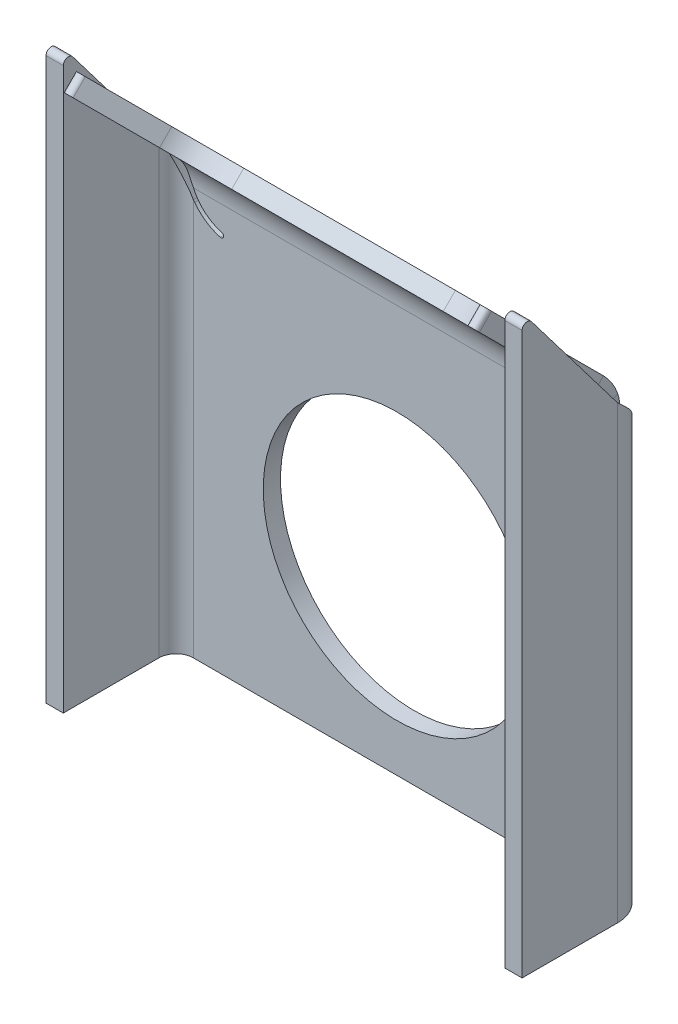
ISO-10303-21;
HEADER;
FILE_DESCRIPTION(('STEP AP214'),'2;1');
FILE_NAME('part.step','',(''),(''),'','','');
FILE_SCHEMA(('AUTOMOTIVE_DESIGN { 1 0 10303 214 1 1 1 1 }'));
ENDSEC;
DATA;
#1=APPLICATION_CONTEXT('core data for automotive mechanical design processes');
#2=APPLICATION_PROTOCOL_DEFINITION('international standard','automotive_design',2000,#1);
#3=PRODUCT_CONTEXT('',#1,'mechanical');
#4=PRODUCT('Part','Part','',(#3));
#5=PRODUCT_RELATED_PRODUCT_CATEGORY('part','',(#4));
#6=PRODUCT_DEFINITION_FORMATION('','',#4);
#7=PRODUCT_DEFINITION_CONTEXT('part definition',#1,'design');
#8=PRODUCT_DEFINITION('design','',#6,#7);
#9=PRODUCT_DEFINITION_SHAPE('','',#8);
#10=(LENGTH_UNIT() NAMED_UNIT(*) SI_UNIT(.MILLI.,.METRE.));
#11=(NAMED_UNIT(*) PLANE_ANGLE_UNIT() SI_UNIT($,.RADIAN.));
#12=(NAMED_UNIT(*) SI_UNIT($,.STERADIAN.) SOLID_ANGLE_UNIT());
#13=UNCERTAINTY_MEASURE_WITH_UNIT(LENGTH_MEASURE(1.E-05),#10,'distance_accuracy_value','');
#14=(GEOMETRIC_REPRESENTATION_CONTEXT(3) GLOBAL_UNCERTAINTY_ASSIGNED_CONTEXT((#13)) GLOBAL_UNIT_ASSIGNED_CONTEXT((#10,
#11,#12)) REPRESENTATION_CONTEXT('',''));
#15=CARTESIAN_POINT('',(0.,0.,0.));
#16=DIRECTION('',(0.,0.,1.));
#17=DIRECTION('',(1.,0.,0.));
#18=AXIS2_PLACEMENT_3D('',#15,#16,#17);
#19=CARTESIAN_POINT('',(194.,220.090302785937,0.));
#20=DIRECTION('',(0.,0.,1.));
#21=DIRECTION('',(1.,0.,0.));
#22=AXIS2_PLACEMENT_3D('',#19,#20,#21);
#23=PLANE('',#22);
#24=CARTESIAN_POINT('',(0.,0.,0.));
#25=DIRECTION('',(0.,0.,1.));
#26=DIRECTION('',(1.,0.,0.));
#27=AXIS2_PLACEMENT_3D('',#24,#25,#26);
#28=CIRCLE('',#27,77.5);
#29=CARTESIAN_POINT('',(77.5,0.,0.));
#30=VERTEX_POINT('',#29);
#31=EDGE_CURVE('E577',#30,#30,#28,.T.);
#32=ORIENTED_EDGE('',*,*,#31,.F.);
#33=EDGE_LOOP('',(#32));
#34=FACE_BOUND('',#33,.T.);
#35=CARTESIAN_POINT('',(95.0000000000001,141.,0.));
#36=DIRECTION('',(0.,0.,1.));
#37=DIRECTION('',(-1.,0.,0.));
#38=AXIS2_PLACEMENT_3D('',#35,#36,#37);
#39=CIRCLE('',#38,25.);
#40=CARTESIAN_POINT('',(101.603773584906,116.887966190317,0.));
#41=VERTEX_POINT('',#40);
#42=CARTESIAN_POINT('',(117.912878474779,131.,0.));
#43=VERTEX_POINT('',#42);
#44=EDGE_CURVE('E528',#41,#43,#39,.T.);
#45=ORIENTED_EDGE('',*,*,#44,.T.);
#46=DIRECTION('',(-1.,0.,0.));
#47=VECTOR('',#46,1.);
#48=CARTESIAN_POINT('',(194.,131.,0.));
#49=LINE('',#48,#47);
#50=CARTESIAN_POINT('',(-117.912878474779,131.,-9.16990858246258E-08));
#51=VERTEX_POINT('',#50);
#52=EDGE_CURVE('E74',#43,#51,#49,.T.);
#53=ORIENTED_EDGE('',*,*,#52,.T.);
#54=CARTESIAN_POINT('',(-95.,141.,0.));
#55=DIRECTION('',(0.,0.,1.));
#56=DIRECTION('',(1.,0.,0.));
#57=AXIS2_PLACEMENT_3D('',#54,#55,#56);
#58=CIRCLE('',#57,25.);
#59=CARTESIAN_POINT('',(-101.603773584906,116.887966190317,0.));
#60=VERTEX_POINT('',#59);
#61=EDGE_CURVE('E531',#51,#60,#58,.T.);
#62=ORIENTED_EDGE('',*,*,#61,.T.);
#63=CARTESIAN_POINT('',(-102.,115.441244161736,0.));
#64=DIRECTION('',(0.,0.,-1.));
#65=DIRECTION('',(1.,0.,0.));
#66=AXIS2_PLACEMENT_3D('',#63,#64,#65);
#67=CIRCLE('',#66,1.50000000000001);
#68=CARTESIAN_POINT('',(-102.396226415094,113.994522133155,0.));
#69=VERTEX_POINT('',#68);
#70=EDGE_CURVE('E728',#60,#69,#67,.T.);
#71=ORIENTED_EDGE('',*,*,#70,.T.);
#72=CARTESIAN_POINT('',(-95.0000000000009,141.,0.));
#73=DIRECTION('',(0.,0.,-1.));
#74=DIRECTION('',(-1.,0.,0.));
#75=AXIS2_PLACEMENT_3D('',#72,#73,#74);
#76=CIRCLE('',#75,27.9999999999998);
#77=CARTESIAN_POINT('',(-117.297526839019,124.064230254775,0.));
#78=VERTEX_POINT('',#77);
#79=EDGE_CURVE('E723',#69,#78,#76,.T.);
#80=ORIENTED_EDGE('',*,*,#79,.T.);
#81=DIRECTION('',(-0.604848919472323,0.796340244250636,0.));
#82=VECTOR('',#81,1.);
#83=CARTESIAN_POINT('',(-117.297526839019,124.064230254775,0.));
#84=LINE('',#83,#82);
#85=CARTESIAN_POINT('',(-118.,124.989101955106,0.));
#86=VERTEX_POINT('',#85);
#87=EDGE_CURVE('E90',#78,#86,#84,.T.);
#88=ORIENTED_EDGE('',*,*,#87,.T.);
#89=DIRECTION('',(0.,1.,0.));
#90=VECTOR('',#89,1.);
#91=CARTESIAN_POINT('',(-118.,220.090302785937,0.));
#92=LINE('',#91,#90);
#93=CARTESIAN_POINT('',(-118.,-105.,0.));
#94=VERTEX_POINT('',#93);
#95=EDGE_CURVE('E674',#94,#86,#92,.T.);
#96=ORIENTED_EDGE('',*,*,#95,.F.);
#97=DIRECTION('',(1.,0.,0.));
#98=VECTOR('',#97,1.);
#99=CARTESIAN_POINT('',(-197.,-105.,0.));
#100=LINE('',#99,#98);
#101=CARTESIAN_POINT('',(118.,-105.,0.));
#102=VERTEX_POINT('',#101);
#103=EDGE_CURVE('E676',#94,#102,#100,.T.);
#104=ORIENTED_EDGE('',*,*,#103,.T.);
#105=DIRECTION('',(0.,1.,0.));
#106=VECTOR('',#105,1.);
#107=CARTESIAN_POINT('',(118.,220.090302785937,0.));
#108=LINE('',#107,#106);
#109=CARTESIAN_POINT('',(118.,124.989101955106,-8.25991809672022E-08));
#110=VERTEX_POINT('',#109);
#111=EDGE_CURVE('E678',#102,#110,#108,.T.);
#112=ORIENTED_EDGE('',*,*,#111,.T.);
#113=DIRECTION('',(-0.604848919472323,-0.796340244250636,0.));
#114=VECTOR('',#113,1.);
#115=CARTESIAN_POINT('',(191.610979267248,221.904849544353,0.));
#116=LINE('',#115,#114);
#117=CARTESIAN_POINT('',(117.297526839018,124.064230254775,0.));
#118=VERTEX_POINT('',#117);
#119=EDGE_CURVE('E622',#110,#118,#116,.T.);
#120=ORIENTED_EDGE('',*,*,#119,.T.);
#121=CARTESIAN_POINT('',(95.0000000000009,141.,0.));
#122=DIRECTION('',(0.,0.,-1.));
#123=DIRECTION('',(1.,0.,0.));
#124=AXIS2_PLACEMENT_3D('',#121,#122,#123);
#125=CIRCLE('',#124,27.9999999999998);
#126=CARTESIAN_POINT('',(102.396226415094,113.994522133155,0.));
#127=VERTEX_POINT('',#126);
#128=EDGE_CURVE('E738',#118,#127,#125,.T.);
#129=ORIENTED_EDGE('',*,*,#128,.T.);
#130=CARTESIAN_POINT('',(102.,115.441244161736,0.));
#131=DIRECTION('',(0.,0.,-1.));
#132=DIRECTION('',(-1.,0.,0.));
#133=AXIS2_PLACEMENT_3D('',#130,#131,#132);
#134=CIRCLE('',#133,1.50000000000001);
#135=EDGE_CURVE('E532',#127,#41,#134,.T.);
#136=ORIENTED_EDGE('',*,*,#135,.T.);
#137=EDGE_LOOP('',(#45,#53,#62,#71,#80,#88,#96,#104,#112,#120,#129,#136));
#138=FACE_BOUND('',#137,.T.);
#139=ADVANCED_FACE('F66',(#34,#138),#23,.T.);
#140=CARTESIAN_POINT('',(-95.,141.,-10.));
#141=DIRECTION('',(0.,0.,1.));
#142=DIRECTION('',(1.,0.,0.));
#143=AXIS2_PLACEMENT_3D('',#140,#141,#142);
#144=CYLINDRICAL_SURFACE('',#143,25.);
#145=ORIENTED_EDGE('',*,*,#61,.F.);
#146=CARTESIAN_POINT('',(-117.912878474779,131.,-10.0000000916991));
#147=CARTESIAN_POINT('',(-117.912878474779,131.,-9.16990875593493E-08));
#148=B_SPLINE_CURVE_WITH_KNOTS('',1,(#146,#147),.UNSPECIFIED.,.F.,.F.,(2,2),(0.,1.),.UNSPECIFIED.);
#149=CARTESIAN_POINT('',(-117.912878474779,131.,-10.0000000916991));
#150=VERTEX_POINT('',#149);
#151=EDGE_CURVE('E525',#51,#150,#148,.F.);
#152=ORIENTED_EDGE('',*,*,#151,.T.);
#153=CARTESIAN_POINT('',(-95.,141.,-10.));
#154=DIRECTION('',(0.,0.,1.));
#155=DIRECTION('',(1.,0.,0.));
#156=AXIS2_PLACEMENT_3D('',#153,#154,#155);
#157=CIRCLE('',#156,25.);
#158=CARTESIAN_POINT('',(-101.603773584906,116.887966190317,-10.));
#159=VERTEX_POINT('',#158);
#160=EDGE_CURVE('E592',#150,#159,#157,.T.);
#161=ORIENTED_EDGE('',*,*,#160,.T.);
#162=DIRECTION('',(0.,0.,1.));
#163=VECTOR('',#162,1.);
#164=CARTESIAN_POINT('',(-101.603773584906,116.887966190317,-10.));
#165=LINE('',#164,#163);
#166=EDGE_CURVE('E750',#159,#60,#165,.T.);
#167=ORIENTED_EDGE('',*,*,#166,.T.);
#168=EDGE_LOOP('',(#145,#152,#161,#167));
#169=FACE_BOUND('',#168,.T.);
#170=ADVANCED_FACE('F555',(#169),#144,.T.);
#171=CARTESIAN_POINT('',(95.0000000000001,141.,-10.));
#172=DIRECTION('',(0.,0.,1.));
#173=DIRECTION('',(1.,0.,0.));
#174=AXIS2_PLACEMENT_3D('',#171,#172,#173);
#175=CYLINDRICAL_SURFACE('',#174,25.);
#176=CARTESIAN_POINT('',(95.0000000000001,141.,-10.));
#177=DIRECTION('',(0.,0.,1.));
#178=DIRECTION('',(-1.,0.,0.));
#179=AXIS2_PLACEMENT_3D('',#176,#177,#178);
#180=CIRCLE('',#179,25.);
#181=CARTESIAN_POINT('',(101.603773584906,116.887966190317,-10.));
#182=VERTEX_POINT('',#181);
#183=CARTESIAN_POINT('',(117.912878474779,131.,-10.0000000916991));
#184=VERTEX_POINT('',#183);
#185=EDGE_CURVE('E583',#182,#184,#180,.T.);
#186=ORIENTED_EDGE('',*,*,#185,.T.);
#187=CARTESIAN_POINT('',(117.912878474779,131.,-9.16990875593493E-08));
#188=CARTESIAN_POINT('',(117.912878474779,131.,-10.0000000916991));
#189=B_SPLINE_CURVE_WITH_KNOTS('',1,(#187,#188),.UNSPECIFIED.,.F.,.F.,(2,2),(0.,1.),.UNSPECIFIED.);
#190=EDGE_CURVE('E12',#184,#43,#189,.F.);
#191=ORIENTED_EDGE('',*,*,#190,.T.);
#192=ORIENTED_EDGE('',*,*,#44,.F.);
#193=DIRECTION('',(0.,0.,1.));
#194=VECTOR('',#193,1.);
#195=CARTESIAN_POINT('',(101.603773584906,116.887966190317,-10.));
#196=LINE('',#195,#194);
#197=EDGE_CURVE('E581',#182,#41,#196,.T.);
#198=ORIENTED_EDGE('',*,*,#197,.F.);
#199=EDGE_LOOP('',(#186,#191,#192,#198));
#200=FACE_BOUND('',#199,.T.);
#201=ADVANCED_FACE('F545',(#200),#175,.T.);
#202=CARTESIAN_POINT('',(194.,220.090302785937,-10.));
#203=DIRECTION('',(0.,0.,1.));
#204=DIRECTION('',(1.,0.,0.));
#205=AXIS2_PLACEMENT_3D('',#202,#203,#204);
#206=PLANE('',#205);
#207=DIRECTION('',(-1.,0.,0.));
#208=VECTOR('',#207,1.);
#209=CARTESIAN_POINT('',(194.,131.,-10.));
#210=LINE('',#209,#208);
#211=EDGE_CURVE('E543',#184,#150,#210,.T.);
#212=ORIENTED_EDGE('',*,*,#211,.F.);
#213=ORIENTED_EDGE('',*,*,#185,.F.);
#214=CARTESIAN_POINT('',(102.,115.441244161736,-10.));
#215=DIRECTION('',(0.,0.,-1.));
#216=DIRECTION('',(-1.,0.,0.));
#217=AXIS2_PLACEMENT_3D('',#214,#215,#216);
#218=CIRCLE('',#217,1.50000000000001);
#219=CARTESIAN_POINT('',(102.396226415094,113.994522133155,-10.));
#220=VERTEX_POINT('',#219);
#221=EDGE_CURVE('E586',#220,#182,#218,.T.);
#222=ORIENTED_EDGE('',*,*,#221,.F.);
#223=CARTESIAN_POINT('',(95.0000000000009,141.,-10.));
#224=DIRECTION('',(0.,0.,-1.));
#225=DIRECTION('',(1.,0.,0.));
#226=AXIS2_PLACEMENT_3D('',#223,#224,#225);
#227=CIRCLE('',#226,27.9999999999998);
#228=CARTESIAN_POINT('',(117.297526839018,124.064230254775,-10.));
#229=VERTEX_POINT('',#228);
#230=EDGE_CURVE('E597',#229,#220,#227,.T.);
#231=ORIENTED_EDGE('',*,*,#230,.F.);
#232=DIRECTION('',(-0.604848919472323,-0.796340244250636,0.));
#233=VECTOR('',#232,1.);
#234=CARTESIAN_POINT('',(191.610979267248,221.904849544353,-10.));
#235=LINE('',#234,#233);
#236=CARTESIAN_POINT('',(118.,124.989101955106,-10.0000000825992));
#237=VERTEX_POINT('',#236);
#238=EDGE_CURVE('E608',#237,#229,#235,.T.);
#239=ORIENTED_EDGE('',*,*,#238,.F.);
#240=DIRECTION('',(0.,1.,0.));
#241=VECTOR('',#240,1.);
#242=CARTESIAN_POINT('',(118.,220.090302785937,-10.));
#243=LINE('',#242,#241);
#244=CARTESIAN_POINT('',(118.,-105.,-10.0000000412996));
#245=VERTEX_POINT('',#244);
#246=EDGE_CURVE('E603',#245,#237,#243,.T.);
#247=ORIENTED_EDGE('',*,*,#246,.F.);
#248=DIRECTION('',(1.,0.,0.));
#249=VECTOR('',#248,1.);
#250=CARTESIAN_POINT('',(-197.,-105.,-10.));
#251=LINE('',#250,#249);
#252=CARTESIAN_POINT('',(-118.,-105.,-10.));
#253=VERTEX_POINT('',#252);
#254=EDGE_CURVE('E680',#253,#245,#251,.T.);
#255=ORIENTED_EDGE('',*,*,#254,.F.);
#256=DIRECTION('',(0.,1.,0.));
#257=VECTOR('',#256,1.);
#258=CARTESIAN_POINT('',(-118.,220.090302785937,-10.));
#259=LINE('',#258,#257);
#260=CARTESIAN_POINT('',(-118.,124.989101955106,-10.0000000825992));
#261=VERTEX_POINT('',#260);
#262=EDGE_CURVE('E675',#253,#261,#259,.T.);
#263=ORIENTED_EDGE('',*,*,#262,.T.);
#264=DIRECTION('',(-0.604848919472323,0.796340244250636,0.));
#265=VECTOR('',#264,1.);
#266=CARTESIAN_POINT('',(-117.297526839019,124.064230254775,-10.));
#267=LINE('',#266,#265);
#268=CARTESIAN_POINT('',(-117.297526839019,124.064230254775,-10.));
#269=VERTEX_POINT('',#268);
#270=EDGE_CURVE('E683',#269,#261,#267,.T.);
#271=ORIENTED_EDGE('',*,*,#270,.F.);
#272=CARTESIAN_POINT('',(-95.0000000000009,141.,-10.));
#273=DIRECTION('',(0.,0.,-1.));
#274=DIRECTION('',(-1.,0.,0.));
#275=AXIS2_PLACEMENT_3D('',#272,#273,#274);
#276=CIRCLE('',#275,27.9999999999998);
#277=CARTESIAN_POINT('',(-102.396226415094,113.994522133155,-10.));
#278=VERTEX_POINT('',#277);
#279=EDGE_CURVE('E745',#278,#269,#276,.T.);
#280=ORIENTED_EDGE('',*,*,#279,.F.);
#281=CARTESIAN_POINT('',(-102.,115.441244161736,-10.));
#282=DIRECTION('',(0.,0.,-1.));
#283=DIRECTION('',(1.,0.,0.));
#284=AXIS2_PLACEMENT_3D('',#281,#282,#283);
#285=CIRCLE('',#284,1.50000000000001);
#286=EDGE_CURVE('E748',#159,#278,#285,.T.);
#287=ORIENTED_EDGE('',*,*,#286,.F.);
#288=ORIENTED_EDGE('',*,*,#160,.F.);
#289=EDGE_LOOP('',(#212,#213,#222,#231,#239,#247,#255,#263,#271,#280,#287,#288));
#290=FACE_BOUND('',#289,.T.);
#291=CARTESIAN_POINT('',(0.,0.,-10.));
#292=DIRECTION('',(0.,0.,1.));
#293=DIRECTION('',(1.,0.,0.));
#294=AXIS2_PLACEMENT_3D('',#291,#292,#293);
#295=CIRCLE('',#294,77.5);
#296=CARTESIAN_POINT('',(77.5,0.,-10.));
#297=VERTEX_POINT('',#296);
#298=EDGE_CURVE('E682',#297,#297,#295,.T.);
#299=ORIENTED_EDGE('',*,*,#298,.T.);
#300=EDGE_LOOP('',(#299));
#301=FACE_BOUND('',#300,.T.);
#302=ADVANCED_FACE('F554',(#290,#301),#206,.F.);
#303=CARTESIAN_POINT('',(138.,220.090302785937,62.4380550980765));
#304=DIRECTION('',(-1.,0.,0.));
#305=DIRECTION('',(0.,0.,1.));
#306=AXIS2_PLACEMENT_3D('',#303,#304,#305);
#307=PLANE('',#306);
#308=DIRECTION('',(0.,0.,1.));
#309=VECTOR('',#308,1.);
#310=CARTESIAN_POINT('',(138.000000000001,-105.,-328.561944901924));
#311=LINE('',#310,#309);
#312=CARTESIAN_POINT('',(138.000000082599,-105.,10.0000000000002));
#313=VERTEX_POINT('',#312);
#314=CARTESIAN_POINT('',(138.,-105.,65.4380550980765));
#315=VERTEX_POINT('',#314);
#316=EDGE_CURVE('E875',#313,#315,#311,.T.);
#317=ORIENTED_EDGE('',*,*,#316,.F.);
#318=DIRECTION('',(0.,1.,0.));
#319=VECTOR('',#318,1.);
#320=CARTESIAN_POINT('',(138.,220.090302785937,10.));
#321=LINE('',#320,#319);
#322=CARTESIAN_POINT('',(138.,156.01060890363,10.));
#323=VERTEX_POINT('',#322);
#324=EDGE_CURVE('E804',#313,#323,#321,.T.);
#325=ORIENTED_EDGE('',*,*,#324,.T.);
#326=DIRECTION('',(0.,-0.796340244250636,-0.604848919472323));
#327=VECTOR('',#326,1.);
#328=CARTESIAN_POINT('',(138.,221.904849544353,60.0490343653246));
#329=LINE('',#328,#327);
#330=CARTESIAN_POINT('',(138.,221.904849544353,60.0490343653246));
#331=VERTEX_POINT('',#330);
#332=EDGE_CURVE('E872',#331,#323,#329,.T.);
#333=ORIENTED_EDGE('',*,*,#332,.F.);
#334=CARTESIAN_POINT('',(138.,220.090302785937,62.4380550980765));
#335=DIRECTION('',(-1.,0.,0.));
#336=DIRECTION('',(0.,0.,1.));
#337=AXIS2_PLACEMENT_3D('',#334,#335,#336);
#338=CIRCLE('',#337,3.);
#339=CARTESIAN_POINT('',(138.,220.090302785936,65.4380550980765));
#340=VERTEX_POINT('',#339);
#341=EDGE_CURVE('E881',#340,#331,#338,.T.);
#342=ORIENTED_EDGE('',*,*,#341,.F.);
#343=DIRECTION('',(0.,1.,0.));
#344=VECTOR('',#343,1.);
#345=CARTESIAN_POINT('',(138.,-105.,65.4380550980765));
#346=LINE('',#345,#344);
#347=EDGE_CURVE('E885',#315,#340,#346,.T.);
#348=ORIENTED_EDGE('',*,*,#347,.F.);
#349=EDGE_LOOP('',(#317,#325,#333,#342,#348));
#350=FACE_BOUND('',#349,.T.);
#351=ADVANCED_FACE('F559',(#350),#307,.F.);
#352=CARTESIAN_POINT('',(138.,-105.,65.4380550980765));
#353=DIRECTION('',(0.,0.,1.));
#354=DIRECTION('',(0.,1.,0.));
#355=AXIS2_PLACEMENT_3D('',#352,#353,#354);
#356=PLANE('',#355);
#357=DIRECTION('',(0.,1.,0.));
#358=VECTOR('',#357,1.);
#359=CARTESIAN_POINT('',(128.,-105.,65.4380550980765));
#360=LINE('',#359,#358);
#361=CARTESIAN_POINT('',(128.,-105.,65.4380550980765));
#362=VERTEX_POINT('',#361);
#363=CARTESIAN_POINT('',(128.,220.090302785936,65.4380550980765));
#364=VERTEX_POINT('',#363);
#365=EDGE_CURVE('E813',#362,#364,#360,.T.);
#366=ORIENTED_EDGE('',*,*,#365,.F.);
#367=DIRECTION('',(-1.,0.,0.));
#368=VECTOR('',#367,1.);
#369=CARTESIAN_POINT('',(138.,-105.,65.4380550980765));
#370=LINE('',#369,#368);
#371=EDGE_CURVE('E878',#315,#362,#370,.T.);
#372=ORIENTED_EDGE('',*,*,#371,.F.);
#373=ORIENTED_EDGE('',*,*,#347,.T.);
#374=DIRECTION('',(-1.,0.,0.));
#375=VECTOR('',#374,1.);
#376=CARTESIAN_POINT('',(138.,220.090302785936,65.4380550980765));
#377=LINE('',#376,#375);
#378=EDGE_CURVE('E883',#340,#364,#377,.T.);
#379=ORIENTED_EDGE('',*,*,#378,.T.);
#380=EDGE_LOOP('',(#366,#372,#373,#379));
#381=FACE_BOUND('',#380,.T.);
#382=ADVANCED_FACE('F565',(#381),#356,.T.);
#383=CARTESIAN_POINT('',(138.000000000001,-105.,-328.561944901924));
#384=DIRECTION('',(0.,-1.,0.));
#385=DIRECTION('',(0.,0.,1.));
#386=AXIS2_PLACEMENT_3D('',#383,#384,#385);
#387=PLANE('',#386);
#388=DIRECTION('',(-1.,0.,0.));
#389=VECTOR('',#388,1.);
#390=CARTESIAN_POINT('',(138.,-105.,10.0000000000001));
#391=LINE('',#390,#389);
#392=CARTESIAN_POINT('',(128.000000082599,-105.,10.0000000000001));
#393=VERTEX_POINT('',#392);
#394=EDGE_CURVE('E877',#313,#393,#391,.T.);
#395=ORIENTED_EDGE('',*,*,#394,.F.);
#396=ORIENTED_EDGE('',*,*,#316,.T.);
#397=ORIENTED_EDGE('',*,*,#371,.T.);
#398=DIRECTION('',(0.,0.,1.));
#399=VECTOR('',#398,1.);
#400=CARTESIAN_POINT('',(128.000000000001,-105.,-328.561944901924));
#401=LINE('',#400,#399);
#402=EDGE_CURVE('E896',#393,#362,#401,.T.);
#403=ORIENTED_EDGE('',*,*,#402,.F.);
#404=EDGE_LOOP('',(#395,#396,#397,#403));
#405=FACE_BOUND('',#404,.T.);
#406=ADVANCED_FACE('F645',(#405),#387,.T.);
#407=CARTESIAN_POINT('',(138.,221.904849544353,60.0490343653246));
#408=DIRECTION('',(0.,0.604848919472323,-0.796340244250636));
#409=DIRECTION('',(0.,-0.796340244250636,-0.604848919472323));
#410=AXIS2_PLACEMENT_3D('',#407,#408,#409);
#411=PLANE('',#410);
#412=CARTESIAN_POINT('',(128.000000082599,156.01060890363,10.));
#413=CARTESIAN_POINT('',(138.000000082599,156.01060890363,9.99999999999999));
#414=B_SPLINE_CURVE_WITH_KNOTS('',1,(#412,#413),.UNSPECIFIED.,.F.,.F.,(2,2),(0.,1.),.UNSPECIFIED.);
#415=CARTESIAN_POINT('',(128.000000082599,156.01060890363,10.0000000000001));
#416=VERTEX_POINT('',#415);
#417=EDGE_CURVE('E690',#416,#323,#414,.T.);
#418=ORIENTED_EDGE('',*,*,#417,.F.);
#419=DIRECTION('',(0.,-0.796340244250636,-0.604848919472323));
#420=VECTOR('',#419,1.);
#421=CARTESIAN_POINT('',(128.,221.904849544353,60.0490343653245));
#422=LINE('',#421,#420);
#423=CARTESIAN_POINT('',(128.,221.904849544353,60.0490343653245));
#424=VERTEX_POINT('',#423);
#425=EDGE_CURVE('E895',#424,#416,#422,.T.);
#426=ORIENTED_EDGE('',*,*,#425,.F.);
#427=DIRECTION('',(-1.,0.,0.));
#428=VECTOR('',#427,1.);
#429=CARTESIAN_POINT('',(138.,221.904849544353,60.0490343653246));
#430=LINE('',#429,#428);
#431=EDGE_CURVE('E880',#331,#424,#430,.T.);
#432=ORIENTED_EDGE('',*,*,#431,.F.);
#433=ORIENTED_EDGE('',*,*,#332,.T.);
#434=EDGE_LOOP('',(#418,#426,#432,#433));
#435=FACE_BOUND('',#434,.T.);
#436=ADVANCED_FACE('F642',(#435),#411,.T.);
#437=CARTESIAN_POINT('',(138.,220.090302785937,62.4380550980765));
#438=DIRECTION('',(-1.,0.,0.));
#439=DIRECTION('',(0.,0.,1.));
#440=AXIS2_PLACEMENT_3D('',#437,#438,#439);
#441=CYLINDRICAL_SURFACE('',#440,3.);
#442=CARTESIAN_POINT('',(128.,220.090302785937,62.4380550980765));
#443=DIRECTION('',(-1.,0.,0.));
#444=DIRECTION('',(0.,0.,1.));
#445=AXIS2_PLACEMENT_3D('',#442,#443,#444);
#446=CIRCLE('',#445,3.);
#447=EDGE_CURVE('E815',#364,#424,#446,.T.);
#448=ORIENTED_EDGE('',*,*,#447,.F.);
#449=ORIENTED_EDGE('',*,*,#378,.F.);
#450=ORIENTED_EDGE('',*,*,#341,.T.);
#451=ORIENTED_EDGE('',*,*,#431,.T.);
#452=EDGE_LOOP('',(#448,#449,#450,#451));
#453=FACE_BOUND('',#452,.T.);
#454=ADVANCED_FACE('F638',(#453),#441,.T.);
#455=CARTESIAN_POINT('',(128.,220.090302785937,62.4380550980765));
#456=DIRECTION('',(-1.,0.,0.));
#457=DIRECTION('',(0.,0.,1.));
#458=AXIS2_PLACEMENT_3D('',#455,#456,#457);
#459=PLANE('',#458);
#460=DIRECTION('',(0.,1.,0.));
#461=VECTOR('',#460,1.);
#462=CARTESIAN_POINT('',(128.,220.090302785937,10.));
#463=LINE('',#462,#461);
#464=EDGE_CURVE('E869',#393,#416,#463,.T.);
#465=ORIENTED_EDGE('',*,*,#464,.F.);
#466=ORIENTED_EDGE('',*,*,#402,.T.);
#467=ORIENTED_EDGE('',*,*,#365,.T.);
#468=ORIENTED_EDGE('',*,*,#447,.T.);
#469=ORIENTED_EDGE('',*,*,#425,.T.);
#470=EDGE_LOOP('',(#465,#466,#467,#468,#469));
#471=FACE_BOUND('',#470,.T.);
#472=ADVANCED_FACE('F641',(#471),#459,.T.);
#473=CARTESIAN_POINT('',(0.,0.,-10.));
#474=DIRECTION('',(0.,0.,1.));
#475=DIRECTION('',(1.,0.,0.));
#476=AXIS2_PLACEMENT_3D('',#473,#474,#475);
#477=CYLINDRICAL_SURFACE('',#476,77.5);
#478=ORIENTED_EDGE('',*,*,#298,.F.);
#479=EDGE_LOOP('',(#478));
#480=FACE_BOUND('',#479,.T.);
#481=ORIENTED_EDGE('',*,*,#31,.T.);
#482=EDGE_LOOP('',(#481));
#483=FACE_BOUND('',#482,.T.);
#484=ADVANCED_FACE('F653',(#480,#483),#477,.F.);
#485=CARTESIAN_POINT('',(95.0000000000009,141.,-10.));
#486=DIRECTION('',(0.,0.,1.));
#487=DIRECTION('',(1.,0.,0.));
#488=AXIS2_PLACEMENT_3D('',#485,#486,#487);
#489=CYLINDRICAL_SURFACE('',#488,27.9999999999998);
#490=ORIENTED_EDGE('',*,*,#128,.F.);
#491=DIRECTION('',(0.,0.,1.));
#492=VECTOR('',#491,1.);
#493=CARTESIAN_POINT('',(117.297526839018,124.064230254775,-10.));
#494=LINE('',#493,#492);
#495=EDGE_CURVE('E610',#229,#118,#494,.T.);
#496=ORIENTED_EDGE('',*,*,#495,.F.);
#497=ORIENTED_EDGE('',*,*,#230,.T.);
#498=DIRECTION('',(0.,0.,1.));
#499=VECTOR('',#498,1.);
#500=CARTESIAN_POINT('',(102.396226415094,113.994522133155,-10.));
#501=LINE('',#500,#499);
#502=EDGE_CURVE('E595',#220,#127,#501,.T.);
#503=ORIENTED_EDGE('',*,*,#502,.T.);
#504=EDGE_LOOP('',(#490,#496,#497,#503));
#505=FACE_BOUND('',#504,.T.);
#506=ADVANCED_FACE('F812',(#505),#489,.F.);
#507=CARTESIAN_POINT('',(102.,115.441244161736,-10.));
#508=DIRECTION('',(0.,0.,1.));
#509=DIRECTION('',(1.,0.,0.));
#510=AXIS2_PLACEMENT_3D('',#507,#508,#509);
#511=CYLINDRICAL_SURFACE('',#510,1.50000000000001);
#512=ORIENTED_EDGE('',*,*,#135,.F.);
#513=ORIENTED_EDGE('',*,*,#502,.F.);
#514=ORIENTED_EDGE('',*,*,#221,.T.);
#515=ORIENTED_EDGE('',*,*,#197,.T.);
#516=EDGE_LOOP('',(#512,#513,#514,#515));
#517=FACE_BOUND('',#516,.T.);
#518=ADVANCED_FACE('F594',(#517),#511,.F.);
#519=CARTESIAN_POINT('',(-102.,115.441244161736,-10.));
#520=DIRECTION('',(0.,0.,1.));
#521=DIRECTION('',(1.,0.,0.));
#522=AXIS2_PLACEMENT_3D('',#519,#520,#521);
#523=CYLINDRICAL_SURFACE('',#522,1.50000000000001);
#524=ORIENTED_EDGE('',*,*,#70,.F.);
#525=ORIENTED_EDGE('',*,*,#166,.F.);
#526=ORIENTED_EDGE('',*,*,#286,.T.);
#527=DIRECTION('',(0.,0.,1.));
#528=VECTOR('',#527,1.);
#529=CARTESIAN_POINT('',(-102.396226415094,113.994522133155,-10.));
#530=LINE('',#529,#528);
#531=EDGE_CURVE('E726',#278,#69,#530,.T.);
#532=ORIENTED_EDGE('',*,*,#531,.T.);
#533=EDGE_LOOP('',(#524,#525,#526,#532));
#534=FACE_BOUND('',#533,.T.);
#535=ADVANCED_FACE('F716',(#534),#523,.F.);
#536=CARTESIAN_POINT('',(-95.0000000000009,141.,-10.));
#537=DIRECTION('',(0.,0.,1.));
#538=DIRECTION('',(1.,0.,0.));
#539=AXIS2_PLACEMENT_3D('',#536,#537,#538);
#540=CYLINDRICAL_SURFACE('',#539,27.9999999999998);
#541=ORIENTED_EDGE('',*,*,#79,.F.);
#542=ORIENTED_EDGE('',*,*,#531,.F.);
#543=ORIENTED_EDGE('',*,*,#279,.T.);
#544=DIRECTION('',(0.,0.,1.));
#545=VECTOR('',#544,1.);
#546=CARTESIAN_POINT('',(-117.297526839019,124.064230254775,-10.));
#547=LINE('',#546,#545);
#548=EDGE_CURVE('E685',#269,#78,#547,.T.);
#549=ORIENTED_EDGE('',*,*,#548,.T.);
#550=EDGE_LOOP('',(#541,#542,#543,#549));
#551=FACE_BOUND('',#550,.T.);
#552=ADVANCED_FACE('F636',(#551),#540,.F.);
#553=CARTESIAN_POINT('',(-117.297526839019,124.064230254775,-10.));
#554=DIRECTION('',(0.796340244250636,0.604848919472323,0.));
#555=DIRECTION('',(-0.604848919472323,0.796340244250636,0.));
#556=AXIS2_PLACEMENT_3D('',#553,#554,#555);
#557=PLANE('',#556);
#558=CARTESIAN_POINT('',(-118.,124.989101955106,-8.25991809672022E-08));
#559=CARTESIAN_POINT('',(-118.,124.989101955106,-10.0000000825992));
#560=B_SPLINE_CURVE_WITH_KNOTS('',1,(#558,#559),.UNSPECIFIED.,.F.,.F.,(2,2),(0.,1.),.UNSPECIFIED.);
#561=EDGE_CURVE('E696',#86,#261,#560,.T.);
#562=ORIENTED_EDGE('',*,*,#561,.F.);
#563=ORIENTED_EDGE('',*,*,#87,.F.);
#564=ORIENTED_EDGE('',*,*,#548,.F.);
#565=ORIENTED_EDGE('',*,*,#270,.T.);
#566=EDGE_LOOP('',(#562,#563,#564,#565));
#567=FACE_BOUND('',#566,.T.);
#568=ADVANCED_FACE('F702',(#567),#557,.T.);
#569=CARTESIAN_POINT('',(-197.,-105.,-10.));
#570=DIRECTION('',(0.,-1.,0.));
#571=DIRECTION('',(1.,0.,0.));
#572=AXIS2_PLACEMENT_3D('',#569,#570,#571);
#573=PLANE('',#572);
#574=DIRECTION('',(0.,0.,1.));
#575=VECTOR('',#574,1.);
#576=CARTESIAN_POINT('',(-118.,-105.,-10.));
#577=LINE('',#576,#575);
#578=EDGE_CURVE('E666',#253,#94,#577,.T.);
#579=ORIENTED_EDGE('',*,*,#578,.F.);
#580=ORIENTED_EDGE('',*,*,#254,.T.);
#581=DIRECTION('',(0.,0.,1.));
#582=VECTOR('',#581,1.);
#583=CARTESIAN_POINT('',(118.,-105.,-10.));
#584=LINE('',#583,#582);
#585=EDGE_CURVE('E679',#245,#102,#584,.T.);
#586=ORIENTED_EDGE('',*,*,#585,.T.);
#587=ORIENTED_EDGE('',*,*,#103,.F.);
#588=EDGE_LOOP('',(#579,#580,#586,#587));
#589=FACE_BOUND('',#588,.T.);
#590=ADVANCED_FACE('F635',(#589),#573,.T.);
#591=CARTESIAN_POINT('',(191.610979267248,221.904849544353,-10.));
#592=DIRECTION('',(-0.796340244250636,0.604848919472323,0.));
#593=DIRECTION('',(-0.604848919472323,-0.796340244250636,0.));
#594=AXIS2_PLACEMENT_3D('',#591,#592,#593);
#595=PLANE('',#594);
#596=ORIENTED_EDGE('',*,*,#119,.F.);
#597=CARTESIAN_POINT('',(118.,124.989101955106,-10.0000000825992));
#598=CARTESIAN_POINT('',(118.,124.989101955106,-8.25991809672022E-08));
#599=B_SPLINE_CURVE_WITH_KNOTS('',1,(#597,#598),.UNSPECIFIED.,.F.,.F.,(2,2),(0.,1.),.UNSPECIFIED.);
#600=EDGE_CURVE('E611',#110,#237,#599,.F.);
#601=ORIENTED_EDGE('',*,*,#600,.T.);
#602=ORIENTED_EDGE('',*,*,#238,.T.);
#603=ORIENTED_EDGE('',*,*,#495,.T.);
#604=EDGE_LOOP('',(#596,#601,#602,#603));
#605=FACE_BOUND('',#604,.T.);
#606=ADVANCED_FACE('F624',(#605),#595,.T.);
#607=CARTESIAN_POINT('',(118.,-105.,10.0000000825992));
#608=DIRECTION('',(0.,-1.,0.));
#609=DIRECTION('',(0.,0.,-1.));
#610=AXIS2_PLACEMENT_3D('',#607,#608,#609);
#611=PLANE('',#610);
#612=ORIENTED_EDGE('',*,*,#394,.T.);
#613=CARTESIAN_POINT('',(118.,-105.,10.));
#614=DIRECTION('',(0.,-1.,0.));
#615=DIRECTION('',(1.,0.,0.));
#616=AXIS2_PLACEMENT_3D('',#613,#614,#615);
#617=CIRCLE('',#616,10.0000000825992);
#618=EDGE_CURVE('E797',#393,#102,#617,.F.);
#619=ORIENTED_EDGE('',*,*,#618,.T.);
#620=ORIENTED_EDGE('',*,*,#585,.F.);
#621=CARTESIAN_POINT('',(118.,-105.,10.0000000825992));
#622=DIRECTION('',(0.,1.,0.));
#623=DIRECTION('',(0.,0.,-1.));
#624=AXIS2_PLACEMENT_3D('',#621,#622,#623);
#625=CIRCLE('',#624,20.0000001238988);
#626=EDGE_CURVE('E794',#313,#245,#625,.T.);
#627=ORIENTED_EDGE('',*,*,#626,.F.);
#628=EDGE_LOOP('',(#612,#619,#620,#627));
#629=FACE_BOUND('',#628,.T.);
#630=ADVANCED_FACE('F634',(#629),#611,.T.);
#631=CARTESIAN_POINT('',(118.,124.989101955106,-10.0000000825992));
#632=CARTESIAN_POINT('',(118.335641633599,125.310189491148,-10.0000000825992));
#633=CARTESIAN_POINT('',(118.85139119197,125.794046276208,-9.99393323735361));
#634=CARTESIAN_POINT('',(119.889925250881,126.763468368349,-9.9135316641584));
#635=CARTESIAN_POINT('',(120.280193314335,127.127243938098,-9.87439524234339));
#636=CARTESIAN_POINT('',(120.929456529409,127.733859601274,-9.78549983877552));
#637=CARTESIAN_POINT('',(121.156504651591,127.946223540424,-9.75080995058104));
#638=CARTESIAN_POINT('',(121.512550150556,128.280007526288,-9.68950222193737));
#639=CARTESIAN_POINT('',(121.633809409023,128.393808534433,-9.66751933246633));
#640=CARTESIAN_POINT('',(121.819491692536,128.568319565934,-9.63200085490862));
#641=CARTESIAN_POINT('',(121.882017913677,128.627124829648,-9.61973725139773));
#642=CARTESIAN_POINT('',(121.976745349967,128.716285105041,-9.60067695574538));
#643=CARTESIAN_POINT('',(122.008477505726,128.746163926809,-9.59421270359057));
#644=CARTESIAN_POINT('',(122.072252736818,128.806239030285,-9.58105770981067));
#645=CARTESIAN_POINT('',(122.110955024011,128.842713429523,-9.5729592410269));
#646=CARTESIAN_POINT('',(122.953722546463,129.637250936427,-9.39480201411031));
#647=CARTESIAN_POINT('',(123.686915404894,130.345621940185,-9.18671912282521));
#648=CARTESIAN_POINT('',(124.663500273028,131.315044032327,-8.86042327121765));
#649=CARTESIAN_POINT('',(124.968567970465,131.622662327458,-8.74920538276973));
#650=CARTESIAN_POINT('',(125.396321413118,132.06080616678,-8.58272968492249));
#651=CARTESIAN_POINT('',(125.533933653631,132.202973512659,-8.52729058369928));
#652=CARTESIAN_POINT('',(125.79937717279,132.479547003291,-8.4171216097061));
#653=CARTESIAN_POINT('',(125.933064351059,132.620165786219,-8.35981690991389));
#654=CARTESIAN_POINT('',(126.987611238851,133.738981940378,-7.89612812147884));
#655=CARTESIAN_POINT('',(127.992489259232,134.88251495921,-7.36895658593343));
#656=CARTESIAN_POINT('',(130.056889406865,137.467640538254,-6.00505895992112));
#657=CARTESIAN_POINT('',(131.11629378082,138.908697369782,-5.16797758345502));
#658=CARTESIAN_POINT('',(133.167977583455,142.091013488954,-3.11629378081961));
#659=CARTESIAN_POINT('',(134.005500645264,143.532873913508,-2.05630306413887));
#660=CARTESIAN_POINT('',(135.028367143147,145.47171809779,-0.507965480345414));
#661=CARTESIAN_POINT('',(135.330634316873,146.080675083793,0.00157408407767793));
#662=CARTESIAN_POINT('',(135.733356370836,146.938123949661,0.74754486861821));
#663=CARTESIAN_POINT('',(135.859155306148,147.214609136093,0.993166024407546));
#664=CARTESIAN_POINT('',(136.036135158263,147.615340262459,1.35616099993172));
#665=CARTESIAN_POINT('',(136.09317542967,147.746584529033,1.47625437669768));
#666=CARTESIAN_POINT('',(136.203507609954,148.004407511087,1.71449776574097));
#667=CARTESIAN_POINT('',(136.254113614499,148.124505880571,1.8265393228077));
#668=CARTESIAN_POINT('',(136.525025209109,148.77813731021,2.44266157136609));
#669=CARTESIAN_POINT('',(136.752108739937,149.362730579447,3.01218093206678));
#670=CARTESIAN_POINT('',(137.078341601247,150.332152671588,3.98878684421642));
#671=CARTESIAN_POINT('',(137.18459762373,150.67071540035,4.33468607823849));
#672=CARTESIAN_POINT('',(137.335696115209,151.201692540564,4.884630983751));
#673=CARTESIAN_POINT('',(137.384675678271,151.382540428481,5.0731251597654));
#674=CARTESIAN_POINT('',(137.4554454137,151.659595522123,5.36366708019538));
#675=CARTESIAN_POINT('',(137.478585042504,151.752911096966,5.46181420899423));
#676=CARTESIAN_POINT('',(137.51253849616,151.894330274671,5.6109858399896));
#677=CARTESIAN_POINT('',(137.523730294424,151.941710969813,5.66103485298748));
#678=CARTESIAN_POINT('',(137.540318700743,152.013143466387,5.73659603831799));
#679=CARTESIAN_POINT('',(137.545814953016,152.037014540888,5.76186437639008));
#680=CARTESIAN_POINT('',(137.556739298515,152.084877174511,5.81256358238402));
#681=CARTESIAN_POINT('',(137.560754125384,152.102565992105,5.83130903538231));
#682=CARTESIAN_POINT('',(137.785365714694,153.104265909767,6.89382755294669));
#683=CARTESIAN_POINT('',(137.886730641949,153.913079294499,7.763892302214));
#684=CARTESIAN_POINT('',(137.993933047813,155.205642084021,9.14860435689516));
#685=CARTESIAN_POINT('',(138.000000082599,155.689506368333,9.66435539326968));
#686=CARTESIAN_POINT('',(138.000000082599,156.01060890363,9.99999999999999));
#687=CARTESIAN_POINT('',(118.,124.989101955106,-8.25991809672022E-08));
#688=CARTESIAN_POINT('',(118.167856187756,125.310257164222,-8.2599180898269E-08));
#689=CARTESIAN_POINT('',(118.425695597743,125.794046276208,0.00303334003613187));
#690=CARTESIAN_POINT('',(118.944962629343,126.763468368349,0.0432341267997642));
#691=CARTESIAN_POINT('',(119.140096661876,127.127243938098,0.0628023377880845));
#692=CARTESIAN_POINT('',(119.464728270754,127.733859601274,0.10725003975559));
#693=CARTESIAN_POINT('',(119.578252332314,127.946223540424,0.124594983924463));
#694=CARTESIAN_POINT('',(119.756275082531,128.280007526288,0.155248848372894));
#695=CARTESIAN_POINT('',(119.816904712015,128.393808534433,0.16624029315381));
#696=CARTESIAN_POINT('',(119.909745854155,128.568319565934,0.183999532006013));
#697=CARTESIAN_POINT('',(119.941008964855,128.627124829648,0.190131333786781));
#698=CARTESIAN_POINT('',(119.988372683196,128.716285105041,0.199661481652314));
#699=CARTESIAN_POINT('',(120.00423876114,128.746163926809,0.202893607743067));
#700=CARTESIAN_POINT('',(120.036126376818,128.806239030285,0.209471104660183));
#701=CARTESIAN_POINT('',(120.055477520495,128.842713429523,0.213520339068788));
#702=CARTESIAN_POINT('',(120.476861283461,129.637250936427,0.302598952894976));
#703=CARTESIAN_POINT('',(120.84345771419,130.345621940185,0.40664039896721));
#704=CARTESIAN_POINT('',(121.331750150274,131.315044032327,0.569788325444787));
#705=CARTESIAN_POINT('',(121.484283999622,131.622662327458,0.625397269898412));
#706=CARTESIAN_POINT('',(121.698160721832,132.06080616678,0.708635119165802));
#707=CARTESIAN_POINT('',(121.766966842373,132.202973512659,0.736354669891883));
#708=CARTESIAN_POINT('',(121.899688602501,132.479547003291,0.791439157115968));
#709=CARTESIAN_POINT('',(121.966532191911,132.620165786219,0.820091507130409));
#710=CARTESIAN_POINT('',(122.493805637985,133.738981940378,1.05193590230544));
#711=CARTESIAN_POINT('',(122.99624465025,134.88251495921,1.31552167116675));
#712=CARTESIAN_POINT('',(124.02844472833,137.467640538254,1.99747048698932));
#713=CARTESIAN_POINT('',(124.558146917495,138.908697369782,2.41601117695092));
#714=CARTESIAN_POINT('',(125.583988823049,142.091013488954,3.44185308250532));
#715=CARTESIAN_POINT('',(126.002750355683,143.532873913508,3.97184844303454));
#716=CARTESIAN_POINT('',(126.514183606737,145.47171809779,4.74601723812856));
#717=CARTESIAN_POINT('',(126.665317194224,146.080675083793,5.00078702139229));
#718=CARTESIAN_POINT('',(126.866678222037,146.938123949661,5.37377241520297));
#719=CARTESIAN_POINT('',(126.929577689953,147.214609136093,5.49658299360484));
#720=CARTESIAN_POINT('',(127.018067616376,147.615340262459,5.67808048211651));
#721=CARTESIAN_POINT('',(127.046587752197,147.746584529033,5.73812717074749));
#722=CARTESIAN_POINT('',(127.101753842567,148.004407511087,5.8572488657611));
#723=CARTESIAN_POINT('',(127.127056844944,148.124505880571,5.91326964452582));
#724=CARTESIAN_POINT('',(127.262512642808,148.77813731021,6.2213307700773));
#725=CARTESIAN_POINT('',(127.376054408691,149.362730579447,6.50609045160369));
#726=CARTESIAN_POINT('',(127.53917084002,150.332152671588,6.99439340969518));
#727=CARTESIAN_POINT('',(127.592298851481,150.67071540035,7.16734302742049));
#728=CARTESIAN_POINT('',(127.667848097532,151.201692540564,7.44231548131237));
#729=CARTESIAN_POINT('',(127.692337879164,151.382540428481,7.5365625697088));
#730=CARTESIAN_POINT('',(127.727722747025,151.659595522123,7.68183353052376));
#731=CARTESIAN_POINT('',(127.739292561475,151.752911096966,7.73090709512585));
#732=CARTESIAN_POINT('',(127.756269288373,151.894330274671,7.80549291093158));
#733=CARTESIAN_POINT('',(127.761865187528,151.941710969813,7.83051741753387));
#734=CARTESIAN_POINT('',(127.770159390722,152.013143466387,7.86829801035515));
#735=CARTESIAN_POINT('',(127.77290751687,152.037014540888,7.88093217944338));
#736=CARTESIAN_POINT('',(127.778369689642,152.084877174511,7.90628178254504));
#737=CARTESIAN_POINT('',(127.780377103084,152.102565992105,7.91565450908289));
#738=CARTESIAN_POINT('',(127.892682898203,153.104265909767,8.44691377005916));
#739=CARTESIAN_POINT('',(127.94336536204,153.913079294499,8.88194614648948));
#740=CARTESIAN_POINT('',(127.996966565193,155.205642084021,9.57430217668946));
#741=CARTESIAN_POINT('',(128.000000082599,155.689438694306,9.83214232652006));
#742=CARTESIAN_POINT('',(128.000000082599,156.01060890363,10.));
#743=B_SPLINE_SURFACE_WITH_KNOTS('',1,3,((#631,#632,#633,#634,#635,#636,#637,#638,#639,#640,
#641,#642,#643,#644,#645,#646,#647,#648,#649,#650,#651,#652,#653,#654,#655,#656,#657,#658,#659,
#660,#661,#662,#663,#664,#665,#666,#667,#668,#669,#670,#671,#672,#673,#674,#675,#676,#677,#678,
#679,#680,#681,#682,#683,#684,#685,#686),(#687,#688,#689,#690,#691,#692,#693,#694,#695,#696,
#697,#698,#699,#700,#701,#702,#703,#704,#705,#706,#707,#708,#709,#710,#711,#712,#713,#714,#715,
#716,#717,#718,#719,#720,#721,#722,#723,#724,#725,#726,#727,#728,#729,#730,#731,#732,#733,#734,
#735,#736,#737,#738,#739,#740,#741,#742)),.UNSPECIFIED.,.F.,.F.,.F.,(2,2),(4,2,2,2,2,2,2,2,2,2,
2,2,2,2,2,2,2,2,2,2,2,2,2,2,2,2,2,4),(0.,1.),(0.,0.0625,0.09375,0.109375,0.1171875,0.12109375,
0.123046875,0.125,0.1875,0.21875,0.234375,0.25,0.375,0.5,0.625,0.6875,0.71875,0.734375,0.75,
0.8125,0.84375,0.859375,0.8671875,0.87109375,0.873046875,0.875,0.9375,1.),.UNSPECIFIED.);
#744=CARTESIAN_POINT('',(118.,124.989101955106,-8.25991809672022E-08));
#745=CARTESIAN_POINT('',(118.167856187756,125.310257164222,-8.2599180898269E-08));
#746=CARTESIAN_POINT('',(118.425695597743,125.794046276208,0.00303334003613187));
#747=CARTESIAN_POINT('',(118.944962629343,126.763468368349,0.0432341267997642));
#748=CARTESIAN_POINT('',(119.140096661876,127.127243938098,0.0628023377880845));
#749=CARTESIAN_POINT('',(119.464728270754,127.733859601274,0.10725003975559));
#750=CARTESIAN_POINT('',(119.578252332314,127.946223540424,0.124594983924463));
#751=CARTESIAN_POINT('',(119.756275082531,128.280007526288,0.155248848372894));
#752=CARTESIAN_POINT('',(119.816904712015,128.393808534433,0.16624029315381));
#753=CARTESIAN_POINT('',(119.909745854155,128.568319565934,0.183999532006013));
#754=CARTESIAN_POINT('',(119.941008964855,128.627124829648,0.190131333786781));
#755=CARTESIAN_POINT('',(119.988372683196,128.716285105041,0.199661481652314));
#756=CARTESIAN_POINT('',(120.00423876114,128.746163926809,0.202893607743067));
#757=CARTESIAN_POINT('',(120.036126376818,128.806239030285,0.209471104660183));
#758=CARTESIAN_POINT('',(120.055477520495,128.842713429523,0.213520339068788));
#759=CARTESIAN_POINT('',(120.476861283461,129.637250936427,0.302598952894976));
#760=CARTESIAN_POINT('',(120.84345771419,130.345621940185,0.40664039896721));
#761=CARTESIAN_POINT('',(121.331750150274,131.315044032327,0.569788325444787));
#762=CARTESIAN_POINT('',(121.484283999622,131.622662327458,0.625397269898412));
#763=CARTESIAN_POINT('',(121.698160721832,132.06080616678,0.708635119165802));
#764=CARTESIAN_POINT('',(121.766966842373,132.202973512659,0.736354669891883));
#765=CARTESIAN_POINT('',(121.899688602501,132.479547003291,0.791439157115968));
#766=CARTESIAN_POINT('',(121.966532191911,132.620165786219,0.820091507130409));
#767=CARTESIAN_POINT('',(122.493805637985,133.738981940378,1.05193590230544));
#768=CARTESIAN_POINT('',(122.99624465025,134.88251495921,1.31552167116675));
#769=CARTESIAN_POINT('',(124.02844472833,137.467640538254,1.99747048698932));
#770=CARTESIAN_POINT('',(124.558146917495,138.908697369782,2.41601117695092));
#771=CARTESIAN_POINT('',(125.583988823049,142.091013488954,3.44185308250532));
#772=CARTESIAN_POINT('',(126.002750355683,143.532873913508,3.97184844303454));
#773=CARTESIAN_POINT('',(126.514183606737,145.47171809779,4.74601723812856));
#774=CARTESIAN_POINT('',(126.665317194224,146.080675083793,5.00078702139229));
#775=CARTESIAN_POINT('',(126.866678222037,146.938123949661,5.37377241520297));
#776=CARTESIAN_POINT('',(126.929577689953,147.214609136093,5.49658299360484));
#777=CARTESIAN_POINT('',(127.018067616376,147.615340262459,5.67808048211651));
#778=CARTESIAN_POINT('',(127.046587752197,147.746584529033,5.73812717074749));
#779=CARTESIAN_POINT('',(127.101753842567,148.004407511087,5.8572488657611));
#780=CARTESIAN_POINT('',(127.127056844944,148.124505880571,5.91326964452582));
#781=CARTESIAN_POINT('',(127.262512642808,148.77813731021,6.2213307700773));
#782=CARTESIAN_POINT('',(127.376054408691,149.362730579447,6.50609045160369));
#783=CARTESIAN_POINT('',(127.53917084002,150.332152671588,6.99439340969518));
#784=CARTESIAN_POINT('',(127.592298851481,150.67071540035,7.16734302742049));
#785=CARTESIAN_POINT('',(127.667848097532,151.201692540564,7.44231548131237));
#786=CARTESIAN_POINT('',(127.692337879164,151.382540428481,7.5365625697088));
#787=CARTESIAN_POINT('',(127.727722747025,151.659595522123,7.68183353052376));
#788=CARTESIAN_POINT('',(127.739292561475,151.752911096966,7.73090709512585));
#789=CARTESIAN_POINT('',(127.756269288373,151.894330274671,7.80549291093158));
#790=CARTESIAN_POINT('',(127.761865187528,151.941710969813,7.83051741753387));
#791=CARTESIAN_POINT('',(127.770159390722,152.013143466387,7.86829801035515));
#792=CARTESIAN_POINT('',(127.77290751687,152.037014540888,7.88093217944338));
#793=CARTESIAN_POINT('',(127.778369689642,152.084877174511,7.90628178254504));
#794=CARTESIAN_POINT('',(127.780377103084,152.102565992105,7.91565450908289));
#795=CARTESIAN_POINT('',(127.892682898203,153.104265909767,8.44691377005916));
#796=CARTESIAN_POINT('',(127.94336536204,153.913079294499,8.88194614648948));
#797=CARTESIAN_POINT('',(127.996966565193,155.205642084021,9.57430217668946));
#798=CARTESIAN_POINT('',(128.000000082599,155.689438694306,9.83214232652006));
#799=CARTESIAN_POINT('',(128.000000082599,156.01060890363,10.));
#800=B_SPLINE_CURVE_WITH_KNOTS('',3,(#744,#745,#746,#747,#748,#749,#750,#751,#752,#753,#754,
#755,#756,#757,#758,#759,#760,#761,#762,#763,#764,#765,#766,#767,#768,#769,#770,#771,#772,#773,
#774,#775,#776,#777,#778,#779,#780,#781,#782,#783,#784,#785,#786,#787,#788,#789,#790,#791,#792,
#793,#794,#795,#796,#797,#798,#799),.UNSPECIFIED.,.F.,.F.,(4,2,2,2,2,2,2,2,2,2,2,2,2,2,2,2,2,2,
2,2,2,2,2,2,2,2,2,4),(0.,0.0625,0.09375,0.109375,0.1171875,0.12109375,0.123046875,0.125,0.1875,
0.21875,0.234375,0.25,0.375,0.5,0.625,0.6875,0.71875,0.734375,0.75,0.8125,0.84375,0.859375,
0.8671875,0.87109375,0.873046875,0.875,0.9375,1.),.UNSPECIFIED.);
#801=EDGE_CURVE('E805',#110,#416,#800,.T.);
#802=CARTESIAN_POINT('',(138.000000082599,156.01060890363,9.99999999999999));
#803=CARTESIAN_POINT('',(138.000000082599,155.689506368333,9.66435539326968));
#804=CARTESIAN_POINT('',(137.993933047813,155.205642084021,9.14860435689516));
#805=CARTESIAN_POINT('',(137.886730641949,153.913079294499,7.763892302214));
#806=CARTESIAN_POINT('',(137.785365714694,153.104265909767,6.89382755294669));
#807=CARTESIAN_POINT('',(137.560754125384,152.102565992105,5.83130903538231));
#808=CARTESIAN_POINT('',(137.556739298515,152.084877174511,5.81256358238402));
#809=CARTESIAN_POINT('',(137.545814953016,152.037014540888,5.76186437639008));
#810=CARTESIAN_POINT('',(137.540318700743,152.013143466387,5.73659603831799));
#811=CARTESIAN_POINT('',(137.523730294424,151.941710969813,5.66103485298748));
#812=CARTESIAN_POINT('',(137.51253849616,151.894330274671,5.6109858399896));
#813=CARTESIAN_POINT('',(137.478585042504,151.752911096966,5.46181420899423));
#814=CARTESIAN_POINT('',(137.4554454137,151.659595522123,5.36366708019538));
#815=CARTESIAN_POINT('',(137.384675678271,151.382540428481,5.0731251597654));
#816=CARTESIAN_POINT('',(137.335696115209,151.201692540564,4.884630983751));
#817=CARTESIAN_POINT('',(137.18459762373,150.67071540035,4.33468607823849));
#818=CARTESIAN_POINT('',(137.078341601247,150.332152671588,3.98878684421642));
#819=CARTESIAN_POINT('',(136.752108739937,149.362730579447,3.01218093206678));
#820=CARTESIAN_POINT('',(136.525025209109,148.77813731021,2.44266157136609));
#821=CARTESIAN_POINT('',(136.254113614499,148.124505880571,1.8265393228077));
#822=CARTESIAN_POINT('',(136.203507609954,148.004407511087,1.71449776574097));
#823=CARTESIAN_POINT('',(136.09317542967,147.746584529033,1.47625437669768));
#824=CARTESIAN_POINT('',(136.036135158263,147.615340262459,1.35616099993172));
#825=CARTESIAN_POINT('',(135.859155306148,147.214609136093,0.993166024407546));
#826=CARTESIAN_POINT('',(135.733356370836,146.938123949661,0.74754486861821));
#827=CARTESIAN_POINT('',(135.330634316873,146.080675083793,0.00157408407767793));
#828=CARTESIAN_POINT('',(135.028367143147,145.47171809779,-0.507965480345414));
#829=CARTESIAN_POINT('',(134.005500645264,143.532873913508,-2.05630306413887));
#830=CARTESIAN_POINT('',(133.167977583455,142.091013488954,-3.11629378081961));
#831=CARTESIAN_POINT('',(131.11629378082,138.908697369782,-5.16797758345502));
#832=CARTESIAN_POINT('',(130.056889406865,137.467640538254,-6.00505895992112));
#833=CARTESIAN_POINT('',(127.992489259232,134.88251495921,-7.36895658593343));
#834=CARTESIAN_POINT('',(126.987611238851,133.738981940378,-7.89612812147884));
#835=CARTESIAN_POINT('',(125.933064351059,132.620165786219,-8.35981690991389));
#836=CARTESIAN_POINT('',(125.79937717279,132.479547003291,-8.4171216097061));
#837=CARTESIAN_POINT('',(125.533933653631,132.202973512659,-8.52729058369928));
#838=CARTESIAN_POINT('',(125.396321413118,132.06080616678,-8.58272968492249));
#839=CARTESIAN_POINT('',(124.968567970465,131.622662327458,-8.74920538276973));
#840=CARTESIAN_POINT('',(124.663500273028,131.315044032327,-8.86042327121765));
#841=CARTESIAN_POINT('',(123.686915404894,130.345621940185,-9.18671912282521));
#842=CARTESIAN_POINT('',(122.953722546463,129.637250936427,-9.39480201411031));
#843=CARTESIAN_POINT('',(122.110955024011,128.842713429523,-9.5729592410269));
#844=CARTESIAN_POINT('',(122.072252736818,128.806239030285,-9.58105770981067));
#845=CARTESIAN_POINT('',(122.008477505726,128.746163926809,-9.59421270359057));
#846=CARTESIAN_POINT('',(121.976745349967,128.716285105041,-9.60067695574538));
#847=CARTESIAN_POINT('',(121.882017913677,128.627124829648,-9.61973725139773));
#848=CARTESIAN_POINT('',(121.819491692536,128.568319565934,-9.63200085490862));
#849=CARTESIAN_POINT('',(121.633809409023,128.393808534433,-9.66751933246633));
#850=CARTESIAN_POINT('',(121.512550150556,128.280007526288,-9.68950222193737));
#851=CARTESIAN_POINT('',(121.156504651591,127.946223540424,-9.75080995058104));
#852=CARTESIAN_POINT('',(120.929456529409,127.733859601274,-9.78549983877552));
#853=CARTESIAN_POINT('',(120.280193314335,127.127243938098,-9.87439524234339));
#854=CARTESIAN_POINT('',(119.889925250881,126.763468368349,-9.9135316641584));
#855=CARTESIAN_POINT('',(118.85139119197,125.794046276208,-9.99393323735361));
#856=CARTESIAN_POINT('',(118.335641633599,125.310189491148,-10.0000000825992));
#857=CARTESIAN_POINT('',(118.,124.989101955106,-10.0000000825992));
#858=B_SPLINE_CURVE_WITH_KNOTS('',3,(#802,#803,#804,#805,#806,#807,#808,#809,#810,#811,#812,
#813,#814,#815,#816,#817,#818,#819,#820,#821,#822,#823,#824,#825,#826,#827,#828,#829,#830,#831,
#832,#833,#834,#835,#836,#837,#838,#839,#840,#841,#842,#843,#844,#845,#846,#847,#848,#849,#850,
#851,#852,#853,#854,#855,#856,#857),.UNSPECIFIED.,.F.,.F.,(4,2,2,2,2,2,2,2,2,2,2,2,2,2,2,2,2,2,
2,2,2,2,2,2,2,2,2,4),(0.,0.0625,0.125,0.126953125,0.12890625,0.1328125,0.140625,0.15625,0.1875,
0.25,0.265625,0.28125,0.3125,0.375,0.5,0.625,0.75,0.765625,0.78125,0.8125,0.875,0.876953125,
0.87890625,0.8828125,0.890625,0.90625,0.9375,1.),.UNSPECIFIED.);
#859=EDGE_CURVE('E605',#237,#323,#858,.F.);
#860=ORIENTED_EDGE('',*,*,#801,.T.);
#861=ORIENTED_EDGE('',*,*,#417,.T.);
#862=ORIENTED_EDGE('',*,*,#859,.F.);
#863=ORIENTED_EDGE('',*,*,#600,.F.);
#864=EDGE_LOOP('',(#860,#861,#862,#863));
#865=FACE_BOUND('',#864,.T.);
#866=ADVANCED_FACE('F823',(#865),#743,.T.);
#867=CARTESIAN_POINT('',(118.,272.257211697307,10.));
#868=DIRECTION('',(0.,-1.,0.));
#869=DIRECTION('',(1.,0.,0.));
#870=AXIS2_PLACEMENT_3D('',#867,#868,#869);
#871=CYLINDRICAL_SURFACE('',#870,20.0000000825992);
#872=ORIENTED_EDGE('',*,*,#246,.T.);
#873=ORIENTED_EDGE('',*,*,#859,.T.);
#874=ORIENTED_EDGE('',*,*,#324,.F.);
#875=ORIENTED_EDGE('',*,*,#626,.T.);
#876=EDGE_LOOP('',(#872,#873,#874,#875));
#877=FACE_BOUND('',#876,.T.);
#878=ADVANCED_FACE('F801',(#877),#871,.T.);
#879=CARTESIAN_POINT('',(118.,272.257211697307,10.));
#880=DIRECTION('',(0.,-1.,0.));
#881=DIRECTION('',(1.,0.,0.));
#882=AXIS2_PLACEMENT_3D('',#879,#880,#881);
#883=CYLINDRICAL_SURFACE('',#882,10.0000000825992);
#884=ORIENTED_EDGE('',*,*,#111,.F.);
#885=ORIENTED_EDGE('',*,*,#618,.F.);
#886=ORIENTED_EDGE('',*,*,#464,.T.);
#887=ORIENTED_EDGE('',*,*,#801,.F.);
#888=EDGE_LOOP('',(#884,#885,#886,#887));
#889=FACE_BOUND('',#888,.T.);
#890=ADVANCED_FACE('F836',(#889),#883,.F.);
#891=CARTESIAN_POINT('',(-118.,-105.,10.0000000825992));
#892=DIRECTION('',(0.,-1.,0.));
#893=DIRECTION('',(0.,0.,-1.));
#894=AXIS2_PLACEMENT_3D('',#891,#892,#893);
#895=PLANE('',#894);
#896=ORIENTED_EDGE('',*,*,#578,.T.);
#897=CARTESIAN_POINT('',(-118.,-105.,10.));
#898=DIRECTION('',(0.,1.,0.));
#899=DIRECTION('',(-1.,0.,0.));
#900=AXIS2_PLACEMENT_3D('',#897,#898,#899);
#901=CIRCLE('',#900,10.0000000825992);
#902=CARTESIAN_POINT('',(-128.,-105.,10.));
#903=VERTEX_POINT('',#902);
#904=EDGE_CURVE('E779',#94,#903,#901,.T.);
#905=ORIENTED_EDGE('',*,*,#904,.T.);
#906=DIRECTION('',(1.,0.,0.));
#907=VECTOR('',#906,1.);
#908=CARTESIAN_POINT('',(-138.,-105.,10.0000000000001));
#909=LINE('',#908,#907);
#910=CARTESIAN_POINT('',(-138.,-105.,10.0000000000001));
#911=VERTEX_POINT('',#910);
#912=EDGE_CURVE('E998',#911,#903,#909,.T.);
#913=ORIENTED_EDGE('',*,*,#912,.F.);
#914=CARTESIAN_POINT('',(-118.,-105.,10.0000000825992));
#915=DIRECTION('',(0.,1.,0.));
#916=DIRECTION('',(0.,0.,-1.));
#917=AXIS2_PLACEMENT_3D('',#914,#915,#916);
#918=CIRCLE('',#917,20.0000001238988);
#919=EDGE_CURVE('E788',#253,#911,#918,.T.);
#920=ORIENTED_EDGE('',*,*,#919,.F.);
#921=EDGE_LOOP('',(#896,#905,#913,#920));
#922=FACE_BOUND('',#921,.T.);
#923=ADVANCED_FACE('F785',(#922),#895,.T.);
#924=CARTESIAN_POINT('',(-138.000000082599,156.01060890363,9.99999999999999));
#925=CARTESIAN_POINT('',(-138.000000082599,155.689848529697,9.6647130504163));
#926=CARTESIAN_POINT('',(-137.993955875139,155.206155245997,9.14914059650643));
#927=CARTESIAN_POINT('',(-137.913581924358,154.236733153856,8.11060439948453));
#928=CARTESIAN_POINT('',(-137.874452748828,153.872916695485,7.7202909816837));
#929=CARTESIAN_POINT('',(-137.785552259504,153.266178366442,7.07089423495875));
#930=CARTESIAN_POINT('',(-137.750857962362,153.053763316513,6.84379070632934));
#931=CARTESIAN_POINT('',(-137.68953745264,152.719887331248,6.48764619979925));
#932=CARTESIAN_POINT('',(-137.667549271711,152.606053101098,6.36635129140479));
#933=CARTESIAN_POINT('',(-137.63202102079,152.43148840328,6.18061164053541));
#934=CARTESIAN_POINT('',(-137.619753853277,152.372664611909,6.11806564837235));
#935=CARTESIAN_POINT('',(-137.600687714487,152.283475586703,6.02330759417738));
#936=CARTESIAN_POINT('',(-137.594221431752,152.253587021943,5.99156507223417));
#937=CARTESIAN_POINT('',(-137.581062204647,152.193492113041,5.9277687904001));
#938=CARTESIAN_POINT('',(-137.572959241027,152.156997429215,5.88904497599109));
#939=CARTESIAN_POINT('',(-137.394802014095,151.362459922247,5.04627745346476));
#940=CARTESIAN_POINT('',(-137.186719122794,150.654088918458,4.3130845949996));
#941=CARTESIAN_POINT('',(-136.860423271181,149.684666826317,3.33649972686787));
#942=CARTESIAN_POINT('',(-136.749205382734,149.377048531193,3.03143202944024));
#943=CARTESIAN_POINT('',(-136.582729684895,148.938904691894,2.60367858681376));
#944=CARTESIAN_POINT('',(-136.527290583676,148.796737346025,2.46606634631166));
#945=CARTESIAN_POINT('',(-136.417121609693,148.520163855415,2.20062282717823));
#946=CARTESIAN_POINT('',(-136.359816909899,148.379545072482,2.06693564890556));
#947=CARTESIAN_POINT('',(-135.896128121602,147.260728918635,1.01238876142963));
#948=CARTESIAN_POINT('',(-135.368956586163,146.117195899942,0.00751074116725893));
#949=CARTESIAN_POINT('',(-134.005058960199,143.532070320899,-2.05688940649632));
#950=CARTESIAN_POINT('',(-133.167977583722,142.091013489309,-3.11629378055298));
#951=CARTESIAN_POINT('',(-131.116293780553,138.908697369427,-5.16797758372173));
#952=CARTESIAN_POINT('',(-130.056303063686,137.466836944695,-6.00550064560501));
#953=CARTESIAN_POINT('',(-128.507965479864,135.527992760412,-7.02836714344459));
#954=CARTESIAN_POINT('',(-127.998425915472,134.919035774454,-7.33063431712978));
#955=CARTESIAN_POINT('',(-127.252455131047,134.06158690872,-7.7333563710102));
#956=CARTESIAN_POINT('',(-127.006833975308,133.785101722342,-7.85915530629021));
#957=CARTESIAN_POINT('',(-126.643838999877,133.384370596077,-8.0361351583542));
#958=CARTESIAN_POINT('',(-126.523745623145,133.253126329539,-8.09317542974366));
#959=CARTESIAN_POINT('',(-126.285502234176,132.995303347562,-8.20350760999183));
#960=CARTESIAN_POINT('',(-126.173460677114,132.875204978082,-8.2541136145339));
#961=CARTESIAN_POINT('',(-125.557338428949,132.221573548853,-8.52502520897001));
#962=CARTESIAN_POINT('',(-124.987819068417,131.636980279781,-8.75210873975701));
#963=CARTESIAN_POINT('',(-124.011213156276,130.66755818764,-9.07834160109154));
#964=CARTESIAN_POINT('',(-123.665313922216,130.328995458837,-9.18459762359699));
#965=CARTESIAN_POINT('',(-123.115369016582,129.7980183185,-9.33569611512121));
#966=CARTESIAN_POINT('',(-122.926874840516,129.617170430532,-9.38467567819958));
#967=CARTESIAN_POINT('',(-122.636332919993,129.340115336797,-9.45544541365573));
#968=CARTESIAN_POINT('',(-122.53818579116,129.246799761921,-9.47858504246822));
#969=CARTESIAN_POINT('',(-122.38901416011,129.105380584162,-9.51253849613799));
#970=CARTESIAN_POINT('',(-122.338965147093,129.057999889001,-9.52373029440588));
#971=CARTESIAN_POINT('',(-122.263403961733,128.986567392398,-9.54031870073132));
#972=CARTESIAN_POINT('',(-122.238135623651,128.962696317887,-9.54581495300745));
#973=CARTESIAN_POINT('',(-122.187436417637,128.914833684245,-9.55673929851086));
#974=CARTESIAN_POINT('',(-122.168680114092,128.89713463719,-9.56075641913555));
#975=CARTESIAN_POINT('',(-121.106519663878,127.895772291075,-9.78529231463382));
#976=CARTESIAN_POINT('',(-120.236637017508,127.087122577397,-9.88667111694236));
#977=CARTESIAN_POINT('',(-118.851927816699,125.794559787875,-9.9939103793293));
#978=CARTESIAN_POINT('',(-118.335999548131,125.310531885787,-10.0000000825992));
#979=CARTESIAN_POINT('',(-118.,124.989101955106,-10.0000000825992));
#980=CARTESIAN_POINT('',(-128.000000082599,156.01060890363,10.));
#981=CARTESIAN_POINT('',(-128.000000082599,155.689780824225,9.83232113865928));
#982=CARTESIAN_POINT('',(-127.996977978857,155.206155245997,9.5745702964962));
#983=CARTESIAN_POINT('',(-127.9567910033,154.236733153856,9.0553021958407));
#984=CARTESIAN_POINT('',(-127.937226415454,153.872916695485,8.8601454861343));
#985=CARTESIAN_POINT('',(-127.892776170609,153.266178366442,8.53544711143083));
#986=CARTESIAN_POINT('',(-127.875429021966,153.053763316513,8.42189534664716));
#987=CARTESIAN_POINT('',(-127.844768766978,152.719887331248,8.24382309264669));
#988=CARTESIAN_POINT('',(-127.833774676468,152.606053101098,8.18317563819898));
#989=CARTESIAN_POINT('',(-127.816010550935,152.43148840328,8.09030581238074));
#990=CARTESIAN_POINT('',(-127.809876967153,152.372664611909,8.05903281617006));
#991=CARTESIAN_POINT('',(-127.800343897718,152.283475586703,8.0116537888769));
#992=CARTESIAN_POINT('',(-127.797110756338,152.253587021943,7.99578252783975));
#993=CARTESIAN_POINT('',(-127.790531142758,152.193492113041,7.96388438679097));
#994=CARTESIAN_POINT('',(-127.786479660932,152.156997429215,7.9445224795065));
#995=CARTESIAN_POINT('',(-127.697401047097,151.362459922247,7.52313871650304));
#996=CARTESIAN_POINT('',(-127.593359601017,150.654088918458,7.15654228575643));
#997=CARTESIAN_POINT('',(-127.430211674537,149.684666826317,6.66824984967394));
#998=CARTESIAN_POINT('',(-127.374602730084,149.377048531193,6.51571600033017));
#999=CARTESIAN_POINT('',(-127.291364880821,148.938904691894,6.30183927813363));
#1000=CARTESIAN_POINT('',(-127.263645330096,148.796737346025,6.23303315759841));
#1001=CARTESIAN_POINT('',(-127.208560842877,148.520163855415,6.10031139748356));
#1002=CARTESIAN_POINT('',(-127.179908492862,148.379545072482,6.03346780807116));
#1003=CARTESIAN_POINT('',(-126.948064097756,147.260728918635,5.50619436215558));
#1004=CARTESIAN_POINT('',(-126.684478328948,146.117195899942,5.00375534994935));
#1005=CARTESIAN_POINT('',(-126.002529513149,143.532070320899,3.97155527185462));
#1006=CARTESIAN_POINT('',(-125.583988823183,142.091013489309,3.44185308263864));
#1007=CARTESIAN_POINT('',(-124.558146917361,138.908697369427,2.41601117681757));
#1008=CARTESIAN_POINT('',(-124.028151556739,137.466836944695,1.99724964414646));
#1009=CARTESIAN_POINT('',(-123.253982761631,135.527992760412,1.48581639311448));
#1010=CARTESIAN_POINT('',(-122.999212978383,134.919035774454,1.3346828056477));
#1011=CARTESIAN_POINT('',(-122.62622758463,134.06158690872,1.13332177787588));
#1012=CARTESIAN_POINT('',(-122.503417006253,133.785101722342,1.07042230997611));
#1013=CARTESIAN_POINT('',(-122.321919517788,133.384370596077,0.981932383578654));
#1014=CARTESIAN_POINT('',(-122.261872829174,133.253126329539,0.953412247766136));
#1015=CARTESIAN_POINT('',(-122.142751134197,132.995303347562,0.898246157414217));
#1016=CARTESIAN_POINT('',(-122.086730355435,132.875204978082,0.872943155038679));
#1017=CARTESIAN_POINT('',(-121.77866923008,132.221573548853,0.737487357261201));
#1018=CARTESIAN_POINT('',(-121.493909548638,131.636980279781,0.623945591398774));
#1019=CARTESIAN_POINT('',(-121.005606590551,130.66755818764,0.460829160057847));
#1020=CARTESIAN_POINT('',(-120.832656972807,130.328995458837,0.407701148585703));
#1021=CARTESIAN_POINT('',(-120.557684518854,129.7980183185,0.332151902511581));
#1022=CARTESIAN_POINT('',(-120.463437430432,129.617170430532,0.307662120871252));
#1023=CARTESIAN_POINT('',(-120.318166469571,129.340115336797,0.272277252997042));
#1024=CARTESIAN_POINT('',(-120.269092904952,129.246799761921,0.260707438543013));
#1025=CARTESIAN_POINT('',(-120.194507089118,129.105380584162,0.243730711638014));
#1026=CARTESIAN_POINT('',(-120.169482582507,129.057999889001,0.238134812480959));
#1027=CARTESIAN_POINT('',(-120.131701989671,128.986567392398,0.229840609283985));
#1028=CARTESIAN_POINT('',(-120.119067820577,128.962696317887,0.227092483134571));
#1029=CARTESIAN_POINT('',(-120.093718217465,128.914833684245,0.221630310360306));
#1030=CARTESIAN_POINT('',(-120.084340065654,128.89713463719,0.219621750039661));
#1031=CARTESIAN_POINT('',(-119.553259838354,127.895772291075,0.107353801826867));
#1032=CARTESIAN_POINT('',(-119.118318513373,127.087122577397,0.0566644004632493));
#1033=CARTESIAN_POINT('',(-118.425963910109,125.794559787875,0.00304476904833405));
#1034=CARTESIAN_POINT('',(-118.168035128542,125.31059952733,-8.25991810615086E-08));
#1035=CARTESIAN_POINT('',(-118.,124.989101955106,-8.25991809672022E-08));
#1036=B_SPLINE_SURFACE_WITH_KNOTS('',1,3,((#924,#925,#926,#927,#928,#929,#930,#931,#932,#933,
#934,#935,#936,#937,#938,#939,#940,#941,#942,#943,#944,#945,#946,#947,#948,#949,#950,#951,#952,
#953,#954,#955,#956,#957,#958,#959,#960,#961,#962,#963,#964,#965,#966,#967,#968,#969,#970,#971,
#972,#973,#974,#975,#976,#977,#978,#979),(#980,#981,#982,#983,#984,#985,#986,#987,#988,#989,
#990,#991,#992,#993,#994,#995,#996,#997,#998,#999,#1000,#1001,#1002,#1003,#1004,#1005,#1006,
#1007,#1008,#1009,#1010,#1011,#1012,#1013,#1014,#1015,#1016,#1017,#1018,#1019,#1020,#1021,#1022,
#1023,#1024,#1025,#1026,#1027,#1028,#1029,#1030,#1031,#1032,#1033,#1034,#1035)),.UNSPECIFIED.,
.F.,.F.,.F.,(2,2),(4,2,2,2,2,2,2,2,2,2,2,2,2,2,2,2,2,2,2,2,2,2,2,2,2,2,2,4),(0.,1.),(0.,0.0625,
0.09375,0.109375,0.1171875,0.12109375,0.123046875,0.125,0.1875,0.21875,0.234375,0.25,0.375,0.5,
0.625,0.6875,0.71875,0.734375,0.75,0.8125,0.84375,0.859375,0.8671875,0.87109375,0.873046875,
0.875,0.9375,1.),.UNSPECIFIED.);
#1037=CARTESIAN_POINT('',(-138.000000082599,156.01060890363,9.99999999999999));
#1038=CARTESIAN_POINT('',(-128.000000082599,156.01060890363,10.));
#1039=B_SPLINE_CURVE_WITH_KNOTS('',1,(#1037,#1038),.UNSPECIFIED.,.F.,.F.,(2,2),(0.,1.),.UNSPECIFIED.);
#1040=CARTESIAN_POINT('',(-128.,156.01060890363,10.));
#1041=VERTEX_POINT('',#1040);
#1042=CARTESIAN_POINT('',(-138.000000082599,156.01060890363,10.0000000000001));
#1043=VERTEX_POINT('',#1042);
#1044=EDGE_CURVE('E982',#1041,#1043,#1039,.F.);
#1045=CARTESIAN_POINT('',(-128.000000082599,156.01060890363,10.));
#1046=CARTESIAN_POINT('',(-128.000000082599,155.689780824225,9.83232113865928));
#1047=CARTESIAN_POINT('',(-127.996977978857,155.206155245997,9.5745702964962));
#1048=CARTESIAN_POINT('',(-127.9567910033,154.236733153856,9.0553021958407));
#1049=CARTESIAN_POINT('',(-127.937226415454,153.872916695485,8.8601454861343));
#1050=CARTESIAN_POINT('',(-127.892776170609,153.266178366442,8.53544711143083));
#1051=CARTESIAN_POINT('',(-127.875429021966,153.053763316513,8.42189534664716));
#1052=CARTESIAN_POINT('',(-127.844768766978,152.719887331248,8.24382309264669));
#1053=CARTESIAN_POINT('',(-127.833774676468,152.606053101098,8.18317563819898));
#1054=CARTESIAN_POINT('',(-127.816010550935,152.43148840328,8.09030581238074));
#1055=CARTESIAN_POINT('',(-127.809876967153,152.372664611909,8.05903281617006));
#1056=CARTESIAN_POINT('',(-127.800343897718,152.283475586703,8.0116537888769));
#1057=CARTESIAN_POINT('',(-127.797110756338,152.253587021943,7.99578252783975));
#1058=CARTESIAN_POINT('',(-127.790531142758,152.193492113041,7.96388438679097));
#1059=CARTESIAN_POINT('',(-127.786479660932,152.156997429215,7.9445224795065));
#1060=CARTESIAN_POINT('',(-127.697401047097,151.362459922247,7.52313871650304));
#1061=CARTESIAN_POINT('',(-127.593359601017,150.654088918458,7.15654228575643));
#1062=CARTESIAN_POINT('',(-127.430211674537,149.684666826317,6.66824984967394));
#1063=CARTESIAN_POINT('',(-127.374602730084,149.377048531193,6.51571600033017));
#1064=CARTESIAN_POINT('',(-127.291364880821,148.938904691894,6.30183927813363));
#1065=CARTESIAN_POINT('',(-127.263645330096,148.796737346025,6.23303315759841));
#1066=CARTESIAN_POINT('',(-127.208560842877,148.520163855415,6.10031139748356));
#1067=CARTESIAN_POINT('',(-127.179908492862,148.379545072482,6.03346780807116));
#1068=CARTESIAN_POINT('',(-126.948064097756,147.260728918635,5.50619436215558));
#1069=CARTESIAN_POINT('',(-126.684478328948,146.117195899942,5.00375534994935));
#1070=CARTESIAN_POINT('',(-126.002529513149,143.532070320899,3.97155527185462));
#1071=CARTESIAN_POINT('',(-125.583988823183,142.091013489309,3.44185308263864));
#1072=CARTESIAN_POINT('',(-124.558146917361,138.908697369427,2.41601117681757));
#1073=CARTESIAN_POINT('',(-124.028151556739,137.466836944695,1.99724964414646));
#1074=CARTESIAN_POINT('',(-123.253982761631,135.527992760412,1.48581639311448));
#1075=CARTESIAN_POINT('',(-122.999212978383,134.919035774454,1.3346828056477));
#1076=CARTESIAN_POINT('',(-122.62622758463,134.06158690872,1.13332177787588));
#1077=CARTESIAN_POINT('',(-122.503417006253,133.785101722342,1.07042230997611));
#1078=CARTESIAN_POINT('',(-122.321919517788,133.384370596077,0.981932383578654));
#1079=CARTESIAN_POINT('',(-122.261872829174,133.253126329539,0.953412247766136));
#1080=CARTESIAN_POINT('',(-122.142751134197,132.995303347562,0.898246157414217));
#1081=CARTESIAN_POINT('',(-122.086730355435,132.875204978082,0.872943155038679));
#1082=CARTESIAN_POINT('',(-121.77866923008,132.221573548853,0.737487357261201));
#1083=CARTESIAN_POINT('',(-121.493909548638,131.636980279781,0.623945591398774));
#1084=CARTESIAN_POINT('',(-121.005606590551,130.66755818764,0.460829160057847));
#1085=CARTESIAN_POINT('',(-120.832656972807,130.328995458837,0.407701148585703));
#1086=CARTESIAN_POINT('',(-120.557684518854,129.7980183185,0.332151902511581));
#1087=CARTESIAN_POINT('',(-120.463437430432,129.617170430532,0.307662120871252));
#1088=CARTESIAN_POINT('',(-120.318166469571,129.340115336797,0.272277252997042));
#1089=CARTESIAN_POINT('',(-120.269092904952,129.246799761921,0.260707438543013));
#1090=CARTESIAN_POINT('',(-120.194507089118,129.105380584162,0.243730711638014));
#1091=CARTESIAN_POINT('',(-120.169482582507,129.057999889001,0.238134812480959));
#1092=CARTESIAN_POINT('',(-120.131701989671,128.986567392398,0.229840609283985));
#1093=CARTESIAN_POINT('',(-120.119067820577,128.962696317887,0.227092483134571));
#1094=CARTESIAN_POINT('',(-120.093718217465,128.914833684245,0.221630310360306));
#1095=CARTESIAN_POINT('',(-120.084340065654,128.89713463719,0.219621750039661));
#1096=CARTESIAN_POINT('',(-119.553259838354,127.895772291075,0.107353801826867));
#1097=CARTESIAN_POINT('',(-119.118318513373,127.087122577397,0.0566644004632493));
#1098=CARTESIAN_POINT('',(-118.425963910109,125.794559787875,0.00304476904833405));
#1099=CARTESIAN_POINT('',(-118.168035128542,125.31059952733,-8.25991810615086E-08));
#1100=CARTESIAN_POINT('',(-118.,124.989101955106,-8.25991809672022E-08));
#1101=B_SPLINE_CURVE_WITH_KNOTS('',3,(#1045,#1046,#1047,#1048,#1049,#1050,#1051,#1052,#1053,
#1054,#1055,#1056,#1057,#1058,#1059,#1060,#1061,#1062,#1063,#1064,#1065,#1066,#1067,#1068,#1069,
#1070,#1071,#1072,#1073,#1074,#1075,#1076,#1077,#1078,#1079,#1080,#1081,#1082,#1083,#1084,#1085,
#1086,#1087,#1088,#1089,#1090,#1091,#1092,#1093,#1094,#1095,#1096,#1097,#1098,#1099,#1100),
.UNSPECIFIED.,.F.,.F.,(4,2,2,2,2,2,2,2,2,2,2,2,2,2,2,2,2,2,2,2,2,2,2,2,2,2,2,4),(0.,0.0625,
0.09375,0.109375,0.1171875,0.12109375,0.123046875,0.125,0.1875,0.21875,0.234375,0.25,0.375,0.5,
0.625,0.6875,0.71875,0.734375,0.75,0.8125,0.84375,0.859375,0.8671875,0.87109375,0.873046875,
0.875,0.9375,1.),.UNSPECIFIED.);
#1102=EDGE_CURVE('E776',#1041,#86,#1101,.T.);
#1103=CARTESIAN_POINT('',(-118.,124.989101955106,-10.0000000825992));
#1104=CARTESIAN_POINT('',(-118.335999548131,125.310531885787,-10.0000000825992));
#1105=CARTESIAN_POINT('',(-118.851927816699,125.794559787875,-9.9939103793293));
#1106=CARTESIAN_POINT('',(-120.236637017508,127.087122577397,-9.88667111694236));
#1107=CARTESIAN_POINT('',(-121.106519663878,127.895772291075,-9.78529231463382));
#1108=CARTESIAN_POINT('',(-122.168680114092,128.89713463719,-9.56075641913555));
#1109=CARTESIAN_POINT('',(-122.187436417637,128.914833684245,-9.55673929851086));
#1110=CARTESIAN_POINT('',(-122.238135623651,128.962696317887,-9.54581495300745));
#1111=CARTESIAN_POINT('',(-122.263403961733,128.986567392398,-9.54031870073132));
#1112=CARTESIAN_POINT('',(-122.338965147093,129.057999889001,-9.52373029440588));
#1113=CARTESIAN_POINT('',(-122.38901416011,129.105380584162,-9.51253849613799));
#1114=CARTESIAN_POINT('',(-122.53818579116,129.246799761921,-9.47858504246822));
#1115=CARTESIAN_POINT('',(-122.636332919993,129.340115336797,-9.45544541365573));
#1116=CARTESIAN_POINT('',(-122.926874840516,129.617170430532,-9.38467567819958));
#1117=CARTESIAN_POINT('',(-123.115369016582,129.7980183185,-9.33569611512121));
#1118=CARTESIAN_POINT('',(-123.665313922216,130.328995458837,-9.18459762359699));
#1119=CARTESIAN_POINT('',(-124.011213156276,130.66755818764,-9.07834160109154));
#1120=CARTESIAN_POINT('',(-124.987819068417,131.636980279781,-8.75210873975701));
#1121=CARTESIAN_POINT('',(-125.557338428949,132.221573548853,-8.52502520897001));
#1122=CARTESIAN_POINT('',(-126.173460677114,132.875204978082,-8.2541136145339));
#1123=CARTESIAN_POINT('',(-126.285502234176,132.995303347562,-8.20350760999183));
#1124=CARTESIAN_POINT('',(-126.523745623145,133.253126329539,-8.09317542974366));
#1125=CARTESIAN_POINT('',(-126.643838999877,133.384370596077,-8.0361351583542));
#1126=CARTESIAN_POINT('',(-127.006833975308,133.785101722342,-7.85915530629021));
#1127=CARTESIAN_POINT('',(-127.252455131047,134.06158690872,-7.7333563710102));
#1128=CARTESIAN_POINT('',(-127.998425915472,134.919035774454,-7.33063431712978));
#1129=CARTESIAN_POINT('',(-128.507965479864,135.527992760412,-7.02836714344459));
#1130=CARTESIAN_POINT('',(-130.056303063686,137.466836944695,-6.00550064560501));
#1131=CARTESIAN_POINT('',(-131.116293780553,138.908697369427,-5.16797758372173));
#1132=CARTESIAN_POINT('',(-133.167977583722,142.091013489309,-3.11629378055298));
#1133=CARTESIAN_POINT('',(-134.005058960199,143.532070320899,-2.05688940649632));
#1134=CARTESIAN_POINT('',(-135.368956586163,146.117195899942,0.00751074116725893));
#1135=CARTESIAN_POINT('',(-135.896128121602,147.260728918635,1.01238876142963));
#1136=CARTESIAN_POINT('',(-136.359816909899,148.379545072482,2.06693564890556));
#1137=CARTESIAN_POINT('',(-136.417121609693,148.520163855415,2.20062282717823));
#1138=CARTESIAN_POINT('',(-136.527290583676,148.796737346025,2.46606634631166));
#1139=CARTESIAN_POINT('',(-136.582729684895,148.938904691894,2.60367858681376));
#1140=CARTESIAN_POINT('',(-136.749205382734,149.377048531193,3.03143202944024));
#1141=CARTESIAN_POINT('',(-136.860423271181,149.684666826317,3.33649972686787));
#1142=CARTESIAN_POINT('',(-137.186719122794,150.654088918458,4.3130845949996));
#1143=CARTESIAN_POINT('',(-137.394802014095,151.362459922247,5.04627745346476));
#1144=CARTESIAN_POINT('',(-137.572959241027,152.156997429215,5.88904497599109));
#1145=CARTESIAN_POINT('',(-137.581062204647,152.193492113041,5.9277687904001));
#1146=CARTESIAN_POINT('',(-137.594221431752,152.253587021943,5.99156507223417));
#1147=CARTESIAN_POINT('',(-137.600687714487,152.283475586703,6.02330759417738));
#1148=CARTESIAN_POINT('',(-137.619753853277,152.372664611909,6.11806564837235));
#1149=CARTESIAN_POINT('',(-137.63202102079,152.43148840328,6.18061164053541));
#1150=CARTESIAN_POINT('',(-137.667549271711,152.606053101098,6.36635129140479));
#1151=CARTESIAN_POINT('',(-137.68953745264,152.719887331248,6.48764619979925));
#1152=CARTESIAN_POINT('',(-137.750857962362,153.053763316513,6.84379070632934));
#1153=CARTESIAN_POINT('',(-137.785552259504,153.266178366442,7.07089423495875));
#1154=CARTESIAN_POINT('',(-137.874452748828,153.872916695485,7.7202909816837));
#1155=CARTESIAN_POINT('',(-137.913581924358,154.236733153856,8.11060439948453));
#1156=CARTESIAN_POINT('',(-137.993955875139,155.206155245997,9.14914059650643));
#1157=CARTESIAN_POINT('',(-138.000000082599,155.689848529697,9.6647130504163));
#1158=CARTESIAN_POINT('',(-138.000000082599,156.01060890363,9.99999999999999));
#1159=B_SPLINE_CURVE_WITH_KNOTS('',3,(#1103,#1104,#1105,#1106,#1107,#1108,#1109,#1110,#1111,
#1112,#1113,#1114,#1115,#1116,#1117,#1118,#1119,#1120,#1121,#1122,#1123,#1124,#1125,#1126,#1127,
#1128,#1129,#1130,#1131,#1132,#1133,#1134,#1135,#1136,#1137,#1138,#1139,#1140,#1141,#1142,#1143,
#1144,#1145,#1146,#1147,#1148,#1149,#1150,#1151,#1152,#1153,#1154,#1155,#1156,#1157,#1158),
.UNSPECIFIED.,.F.,.F.,(4,2,2,2,2,2,2,2,2,2,2,2,2,2,2,2,2,2,2,2,2,2,2,2,2,2,2,4),(0.,0.0625,
0.125,0.126953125,0.12890625,0.1328125,0.140625,0.15625,0.1875,0.25,0.265625,0.28125,0.3125,
0.375,0.5,0.625,0.75,0.765625,0.78125,0.8125,0.875,0.876953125,0.87890625,0.8828125,0.890625,
0.90625,0.9375,1.),.UNSPECIFIED.);
#1160=EDGE_CURVE('E913',#1043,#261,#1159,.F.);
#1161=ORIENTED_EDGE('',*,*,#1044,.F.);
#1162=ORIENTED_EDGE('',*,*,#1102,.T.);
#1163=ORIENTED_EDGE('',*,*,#561,.T.);
#1164=ORIENTED_EDGE('',*,*,#1160,.F.);
#1165=EDGE_LOOP('',(#1161,#1162,#1163,#1164));
#1166=FACE_BOUND('',#1165,.T.);
#1167=ADVANCED_FACE('F949',(#1166),#1036,.T.);
#1168=CARTESIAN_POINT('',(-118.,-252.268109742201,10.));
#1169=DIRECTION('',(0.,1.,0.));
#1170=DIRECTION('',(-1.,0.,0.));
#1171=AXIS2_PLACEMENT_3D('',#1168,#1169,#1170);
#1172=CYLINDRICAL_SURFACE('',#1171,20.0000000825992);
#1173=ORIENTED_EDGE('',*,*,#1160,.T.);
#1174=ORIENTED_EDGE('',*,*,#262,.F.);
#1175=ORIENTED_EDGE('',*,*,#919,.T.);
#1176=DIRECTION('',(0.,1.,0.));
#1177=VECTOR('',#1176,1.);
#1178=CARTESIAN_POINT('',(-138.,220.090302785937,10.0000000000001));
#1179=LINE('',#1178,#1177);
#1180=EDGE_CURVE('E1014',#911,#1043,#1179,.T.);
#1181=ORIENTED_EDGE('',*,*,#1180,.T.);
#1182=EDGE_LOOP('',(#1173,#1174,#1175,#1181));
#1183=FACE_BOUND('',#1182,.T.);
#1184=ADVANCED_FACE('F954',(#1183),#1172,.T.);
#1185=CARTESIAN_POINT('',(-118.,-252.268109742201,10.));
#1186=DIRECTION('',(0.,1.,0.));
#1187=DIRECTION('',(-1.,0.,0.));
#1188=AXIS2_PLACEMENT_3D('',#1185,#1186,#1187);
#1189=CYLINDRICAL_SURFACE('',#1188,10.0000000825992);
#1190=ORIENTED_EDGE('',*,*,#1102,.F.);
#1191=DIRECTION('',(0.,1.,0.));
#1192=VECTOR('',#1191,1.);
#1193=CARTESIAN_POINT('',(-128.,220.090302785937,10.));
#1194=LINE('',#1193,#1192);
#1195=EDGE_CURVE('E997',#903,#1041,#1194,.T.);
#1196=ORIENTED_EDGE('',*,*,#1195,.F.);
#1197=ORIENTED_EDGE('',*,*,#904,.F.);
#1198=ORIENTED_EDGE('',*,*,#95,.T.);
#1199=EDGE_LOOP('',(#1190,#1196,#1197,#1198));
#1200=FACE_BOUND('',#1199,.T.);
#1201=ADVANCED_FACE('F488',(#1200),#1189,.F.);
#1202=CARTESIAN_POINT('',(-138.,220.090302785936,62.4380550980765));
#1203=DIRECTION('',(1.,0.,0.));
#1204=DIRECTION('',(0.,0.,-1.));
#1205=AXIS2_PLACEMENT_3D('',#1202,#1203,#1204);
#1206=CYLINDRICAL_SURFACE('',#1205,3.);
#1207=CARTESIAN_POINT('',(-128.,220.090302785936,62.4380550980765));
#1208=DIRECTION('',(1.,0.,0.));
#1209=DIRECTION('',(0.,0.,-1.));
#1210=AXIS2_PLACEMENT_3D('',#1207,#1208,#1209);
#1211=CIRCLE('',#1210,3.);
#1212=CARTESIAN_POINT('',(-128.,221.904849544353,60.0490343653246));
#1213=VERTEX_POINT('',#1212);
#1214=CARTESIAN_POINT('',(-128.,220.090302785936,65.4380550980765));
#1215=VERTEX_POINT('',#1214);
#1216=EDGE_CURVE('E988',#1213,#1215,#1211,.T.);
#1217=ORIENTED_EDGE('',*,*,#1216,.F.);
#1218=DIRECTION('',(1.,0.,0.));
#1219=VECTOR('',#1218,1.);
#1220=CARTESIAN_POINT('',(-138.,221.904849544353,60.0490343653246));
#1221=LINE('',#1220,#1219);
#1222=CARTESIAN_POINT('',(-138.,221.904849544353,60.0490343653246));
#1223=VERTEX_POINT('',#1222);
#1224=EDGE_CURVE('E474',#1223,#1213,#1221,.T.);
#1225=ORIENTED_EDGE('',*,*,#1224,.F.);
#1226=CARTESIAN_POINT('',(-138.,220.090302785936,62.4380550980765));
#1227=DIRECTION('',(1.,0.,0.));
#1228=DIRECTION('',(0.,0.,-1.));
#1229=AXIS2_PLACEMENT_3D('',#1226,#1227,#1228);
#1230=CIRCLE('',#1229,3.);
#1231=CARTESIAN_POINT('',(-138.,220.090302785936,65.4380550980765));
#1232=VERTEX_POINT('',#1231);
#1233=EDGE_CURVE('E1011',#1223,#1232,#1230,.T.);
#1234=ORIENTED_EDGE('',*,*,#1233,.T.);
#1235=DIRECTION('',(1.,0.,0.));
#1236=VECTOR('',#1235,1.);
#1237=CARTESIAN_POINT('',(-138.,220.090302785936,65.4380550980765));
#1238=LINE('',#1237,#1236);
#1239=EDGE_CURVE('E1009',#1232,#1215,#1238,.T.);
#1240=ORIENTED_EDGE('',*,*,#1239,.T.);
#1241=EDGE_LOOP('',(#1217,#1225,#1234,#1240));
#1242=FACE_BOUND('',#1241,.T.);
#1243=ADVANCED_FACE('F484',(#1242),#1206,.T.);
#1244=CARTESIAN_POINT('',(-138.,220.090302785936,65.4380550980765));
#1245=DIRECTION('',(0.,0.,1.));
#1246=DIRECTION('',(0.,-1.,0.));
#1247=AXIS2_PLACEMENT_3D('',#1244,#1245,#1246);
#1248=PLANE('',#1247);
#1249=DIRECTION('',(0.,-1.,0.));
#1250=VECTOR('',#1249,1.);
#1251=CARTESIAN_POINT('',(-128.,220.090302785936,65.4380550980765));
#1252=LINE('',#1251,#1250);
#1253=CARTESIAN_POINT('',(-128.,-105.,65.4380550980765));
#1254=VERTEX_POINT('',#1253);
#1255=EDGE_CURVE('E985',#1215,#1254,#1252,.T.);
#1256=ORIENTED_EDGE('',*,*,#1255,.F.);
#1257=ORIENTED_EDGE('',*,*,#1239,.F.);
#1258=DIRECTION('',(0.,-1.,0.));
#1259=VECTOR('',#1258,1.);
#1260=CARTESIAN_POINT('',(-138.,220.090302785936,65.4380550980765));
#1261=LINE('',#1260,#1259);
#1262=CARTESIAN_POINT('',(-138.,-105.,65.4380550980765));
#1263=VERTEX_POINT('',#1262);
#1264=EDGE_CURVE('E1006',#1232,#1263,#1261,.T.);
#1265=ORIENTED_EDGE('',*,*,#1264,.T.);
#1266=DIRECTION('',(1.,0.,0.));
#1267=VECTOR('',#1266,1.);
#1268=CARTESIAN_POINT('',(-138.,-105.,65.4380550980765));
#1269=LINE('',#1268,#1267);
#1270=EDGE_CURVE('E1004',#1263,#1254,#1269,.T.);
#1271=ORIENTED_EDGE('',*,*,#1270,.T.);
#1272=EDGE_LOOP('',(#1256,#1257,#1265,#1271));
#1273=FACE_BOUND('',#1272,.T.);
#1274=ADVANCED_FACE('F487',(#1273),#1248,.T.);
#1275=CARTESIAN_POINT('',(-138.000000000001,220.090302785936,-325.561944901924));
#1276=DIRECTION('',(1.,0.,0.));
#1277=DIRECTION('',(0.,0.,-1.));
#1278=AXIS2_PLACEMENT_3D('',#1275,#1276,#1277);
#1279=PLANE('',#1278);
#1280=ORIENTED_EDGE('',*,*,#1180,.F.);
#1281=DIRECTION('',(0.,0.,-1.));
#1282=VECTOR('',#1281,1.);
#1283=CARTESIAN_POINT('',(-138.,-105.,65.4380550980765));
#1284=LINE('',#1283,#1282);
#1285=EDGE_CURVE('E1001',#1263,#911,#1284,.T.);
#1286=ORIENTED_EDGE('',*,*,#1285,.F.);
#1287=ORIENTED_EDGE('',*,*,#1264,.F.);
#1288=ORIENTED_EDGE('',*,*,#1233,.F.);
#1289=DIRECTION('',(0.,0.796340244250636,0.604848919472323));
#1290=VECTOR('',#1289,1.);
#1291=CARTESIAN_POINT('',(-138.,124.064230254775,-14.264418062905));
#1292=LINE('',#1291,#1290);
#1293=EDGE_CURVE('E984',#1043,#1223,#1292,.T.);
#1294=ORIENTED_EDGE('',*,*,#1293,.F.);
#1295=EDGE_LOOP('',(#1280,#1286,#1287,#1288,#1294));
#1296=FACE_BOUND('',#1295,.T.);
#1297=ADVANCED_FACE('F492',(#1296),#1279,.F.);
#1298=CARTESIAN_POINT('',(-138.,-105.,65.4380550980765));
#1299=DIRECTION('',(0.,-1.,0.));
#1300=DIRECTION('',(0.,0.,-1.));
#1301=AXIS2_PLACEMENT_3D('',#1298,#1299,#1300);
#1302=PLANE('',#1301);
#1303=ORIENTED_EDGE('',*,*,#1285,.T.);
#1304=ORIENTED_EDGE('',*,*,#912,.T.);
#1305=DIRECTION('',(0.,0.,-1.));
#1306=VECTOR('',#1305,1.);
#1307=CARTESIAN_POINT('',(-128.,-105.,65.4380550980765));
#1308=LINE('',#1307,#1306);
#1309=EDGE_CURVE('E995',#1254,#903,#1308,.T.);
#1310=ORIENTED_EDGE('',*,*,#1309,.F.);
#1311=ORIENTED_EDGE('',*,*,#1270,.F.);
#1312=EDGE_LOOP('',(#1303,#1304,#1310,#1311));
#1313=FACE_BOUND('',#1312,.T.);
#1314=ADVANCED_FACE('F496',(#1313),#1302,.T.);
#1315=CARTESIAN_POINT('',(-128.000000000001,220.090302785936,-325.561944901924));
#1316=DIRECTION('',(1.,0.,0.));
#1317=DIRECTION('',(0.,0.,-1.));
#1318=AXIS2_PLACEMENT_3D('',#1315,#1316,#1317);
#1319=PLANE('',#1318);
#1320=ORIENTED_EDGE('',*,*,#1309,.T.);
#1321=ORIENTED_EDGE('',*,*,#1195,.T.);
#1322=DIRECTION('',(0.,0.796340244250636,0.604848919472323));
#1323=VECTOR('',#1322,1.);
#1324=CARTESIAN_POINT('',(-128.,124.064230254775,-14.264418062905));
#1325=LINE('',#1324,#1323);
#1326=EDGE_CURVE('E992',#1041,#1213,#1325,.T.);
#1327=ORIENTED_EDGE('',*,*,#1326,.T.);
#1328=ORIENTED_EDGE('',*,*,#1216,.T.);
#1329=ORIENTED_EDGE('',*,*,#1255,.T.);
#1330=EDGE_LOOP('',(#1320,#1321,#1327,#1328,#1329));
#1331=FACE_BOUND('',#1330,.T.);
#1332=ADVANCED_FACE('F500',(#1331),#1319,.T.);
#1333=CARTESIAN_POINT('',(-138.,124.064230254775,-14.264418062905));
#1334=DIRECTION('',(0.,0.604848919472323,-0.796340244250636));
#1335=DIRECTION('',(0.,0.796340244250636,0.604848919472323));
#1336=AXIS2_PLACEMENT_3D('',#1333,#1334,#1335);
#1337=PLANE('',#1336);
#1338=ORIENTED_EDGE('',*,*,#1326,.F.);
#1339=ORIENTED_EDGE('',*,*,#1044,.T.);
#1340=ORIENTED_EDGE('',*,*,#1293,.T.);
#1341=ORIENTED_EDGE('',*,*,#1224,.T.);
#1342=EDGE_LOOP('',(#1338,#1339,#1340,#1341));
#1343=FACE_BOUND('',#1342,.T.);
#1344=ADVANCED_FACE('F504',(#1343),#1337,.T.);
#1345=CARTESIAN_POINT('',(120.,131.,25.0000000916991));
#1346=DIRECTION('',(1.,0.,0.));
#1347=DIRECTION('',(0.,0.,-1.));
#1348=AXIS2_PLACEMENT_3D('',#1345,#1346,#1347);
#1349=PLANE('',#1348);
#1350=DIRECTION('',(0.,-0.707106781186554,0.707106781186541));
#1351=VECTOR('',#1350,1.);
#1352=CARTESIAN_POINT('',(120.,155.748737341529,0.251262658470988));
#1353=LINE('',#1352,#1351);
#1354=CARTESIAN_POINT('',(120.,155.74873740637,0.251262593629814));
#1355=VERTEX_POINT('',#1354);
#1356=CARTESIAN_POINT('',(120.,148.677669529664,7.32233047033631));
#1357=VERTEX_POINT('',#1356);
#1358=EDGE_CURVE('E296',#1355,#1357,#1353,.T.);
#1359=ORIENTED_EDGE('',*,*,#1358,.T.);
#1360=CARTESIAN_POINT('',(120.,131.,25.));
#1361=DIRECTION('',(1.,0.,0.));
#1362=DIRECTION('',(0.,0.,-1.));
#1363=AXIS2_PLACEMENT_3D('',#1360,#1361,#1362);
#1364=CIRCLE('',#1363,25.0000000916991);
#1365=CARTESIAN_POINT('',(120.,139.179867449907,1.37607625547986));
#1366=VERTEX_POINT('',#1365);
#1367=EDGE_CURVE('E308',#1357,#1366,#1364,.F.);
#1368=ORIENTED_EDGE('',*,*,#1367,.T.);
#1369=CARTESIAN_POINT('',(120.,142.451814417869,-8.07349320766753));
#1370=CARTESIAN_POINT('',(120.,139.179867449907,1.37607625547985));
#1371=B_SPLINE_CURVE_WITH_KNOTS('',1,(#1369,#1370),.UNSPECIFIED.,.F.,.F.,(2,2),(0.,1.),.UNSPECIFIED.);
#1372=CARTESIAN_POINT('',(120.,142.451814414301,-8.07349319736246));
#1373=VERTEX_POINT('',#1372);
#1374=EDGE_CURVE('E437',#1366,#1373,#1371,.F.);
#1375=ORIENTED_EDGE('',*,*,#1374,.T.);
#1376=CARTESIAN_POINT('',(120.,131.,25.0000000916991));
#1377=DIRECTION('',(-1.,0.,0.));
#1378=DIRECTION('',(0.,0.,-1.));
#1379=AXIS2_PLACEMENT_3D('',#1376,#1377,#1378);
#1380=CIRCLE('',#1379,35.0000001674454);
#1381=EDGE_CURVE('E373',#1355,#1373,#1380,.T.);
#1382=ORIENTED_EDGE('',*,*,#1381,.F.);
#1383=EDGE_LOOP('',(#1359,#1368,#1375,#1382));
#1384=FACE_BOUND('',#1383,.T.);
#1385=ADVANCED_FACE('F408',(#1384),#1349,.T.);
#1386=CARTESIAN_POINT('',(120.,142.451814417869,-8.07349320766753));
#1387=CARTESIAN_POINT('',(119.991189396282,141.469545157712,-8.413607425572));
#1388=CARTESIAN_POINT('',(119.943580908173,140.496534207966,-8.70151698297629));
#1389=CARTESIAN_POINT('',(119.813969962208,139.059118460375,-9.0630990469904));
#1390=CARTESIAN_POINT('',(119.76106668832,138.58365436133,-9.17191508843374));
#1391=CARTESIAN_POINT('',(119.667162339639,137.876862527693,-9.31860523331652));
#1392=CARTESIAN_POINT('',(119.63343598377,137.642331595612,-9.3647464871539));
#1393=CARTESIAN_POINT('',(119.579209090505,137.292237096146,-9.42995570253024));
#1394=CARTESIAN_POINT('',(119.560527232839,137.175822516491,-9.45102500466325));
#1395=CARTESIAN_POINT('',(119.531595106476,137.001638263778,-9.48164468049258));
#1396=CARTESIAN_POINT('',(119.52179950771,136.943649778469,-9.49168719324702));
#1397=CARTESIAN_POINT('',(119.506878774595,136.856777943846,-9.5065069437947));
#1398=CARTESIAN_POINT('',(119.501867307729,136.827839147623,-9.51140619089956));
#1399=CARTESIAN_POINT('',(119.491768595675,136.769998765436,-9.52112368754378));
#1400=CARTESIAN_POINT('',(119.485672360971,136.735410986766,-9.52688257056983));
#1401=CARTESIAN_POINT('',(119.218122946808,135.227627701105,-9.77630631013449));
#1402=CARTESIAN_POINT('',(118.695793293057,133.322161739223,-10.0000000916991));
#1403=CARTESIAN_POINT('',(117.912878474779,131.,-10.0000000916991));
#1404=CARTESIAN_POINT('',(120.,139.179867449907,1.37607625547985));
#1405=CARTESIAN_POINT('',(119.991189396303,138.478246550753,1.13313752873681));
#1406=CARTESIAN_POINT('',(119.943580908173,137.783238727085,0.927487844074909));
#1407=CARTESIAN_POINT('',(119.813969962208,136.756513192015,0.669214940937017));
#1408=CARTESIAN_POINT('',(119.76106668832,136.416895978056,0.591489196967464));
#1409=CARTESIAN_POINT('',(119.667162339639,135.912044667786,0.486710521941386));
#1410=CARTESIAN_POINT('',(119.63343598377,135.744522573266,0.453752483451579));
#1411=CARTESIAN_POINT('',(119.579209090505,135.494455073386,0.407174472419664));
#1412=CARTESIAN_POINT('',(119.560527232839,135.411301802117,0.392124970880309));
#1413=CARTESIAN_POINT('',(119.531595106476,135.28688447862,0.370253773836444));
#1414=CARTESIAN_POINT('',(119.52179950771,135.245464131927,0.363080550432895));
#1415=CARTESIAN_POINT('',(119.506878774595,135.183412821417,0.352495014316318));
#1416=CARTESIAN_POINT('',(119.501867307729,135.162742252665,0.348995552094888));
#1417=CARTESIAN_POINT('',(119.491768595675,135.121427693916,0.342054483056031));
#1418=CARTESIAN_POINT('',(119.485672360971,135.096722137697,0.33794099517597));
#1419=CARTESIAN_POINT('',(119.218122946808,134.019734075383,0.159781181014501));
#1420=CARTESIAN_POINT('',(118.695743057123,132.658580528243,-9.16990875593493E-08));
#1421=CARTESIAN_POINT('',(117.912878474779,131.,-9.16990875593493E-08));
#1422=B_SPLINE_SURFACE_WITH_KNOTS('',1,3,((#1386,#1387,#1388,#1389,#1390,#1391,#1392,#1393,
#1394,#1395,#1396,#1397,#1398,#1399,#1400,#1401,#1402,#1403),(#1404,#1405,#1406,#1407,#1408,
#1409,#1410,#1411,#1412,#1413,#1414,#1415,#1416,#1417,#1418,#1419,#1420,#1421)),.UNSPECIFIED.,
.F.,.F.,.F.,(2,2),(4,2,2,2,2,2,2,2,4),(0.,1.),(0.,0.25,0.375,0.4375,0.46875,0.484375,0.4921875,
0.5,1.),.UNSPECIFIED.);
#1423=CARTESIAN_POINT('',(120.,139.179867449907,1.37607625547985));
#1424=CARTESIAN_POINT('',(119.991189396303,138.478246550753,1.13313752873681));
#1425=CARTESIAN_POINT('',(119.943580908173,137.783238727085,0.927487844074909));
#1426=CARTESIAN_POINT('',(119.813969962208,136.756513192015,0.669214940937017));
#1427=CARTESIAN_POINT('',(119.76106668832,136.416895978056,0.591489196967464));
#1428=CARTESIAN_POINT('',(119.667162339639,135.912044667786,0.486710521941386));
#1429=CARTESIAN_POINT('',(119.63343598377,135.744522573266,0.453752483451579));
#1430=CARTESIAN_POINT('',(119.579209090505,135.494455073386,0.407174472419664));
#1431=CARTESIAN_POINT('',(119.560527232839,135.411301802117,0.392124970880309));
#1432=CARTESIAN_POINT('',(119.531595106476,135.28688447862,0.370253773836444));
#1433=CARTESIAN_POINT('',(119.52179950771,135.245464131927,0.363080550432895));
#1434=CARTESIAN_POINT('',(119.506878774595,135.183412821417,0.352495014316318));
#1435=CARTESIAN_POINT('',(119.501867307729,135.162742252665,0.348995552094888));
#1436=CARTESIAN_POINT('',(119.491768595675,135.121427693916,0.342054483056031));
#1437=CARTESIAN_POINT('',(119.485672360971,135.096722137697,0.33794099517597));
#1438=CARTESIAN_POINT('',(119.218122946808,134.019734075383,0.159781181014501));
#1439=CARTESIAN_POINT('',(118.695743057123,132.658580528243,-9.16990875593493E-08));
#1440=CARTESIAN_POINT('',(117.912878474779,131.,-9.16990875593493E-08));
#1441=B_SPLINE_CURVE_WITH_KNOTS('',3,(#1423,#1424,#1425,#1426,#1427,#1428,#1429,#1430,#1431,
#1432,#1433,#1434,#1435,#1436,#1437,#1438,#1439,#1440),.UNSPECIFIED.,.F.,.F.,(4,2,2,2,2,2,2,2,
4),(0.,0.25,0.375,0.4375,0.46875,0.484375,0.4921875,0.5,1.),.UNSPECIFIED.);
#1442=EDGE_CURVE('E81',#1366,#43,#1441,.T.);
#1443=CARTESIAN_POINT('',(117.912878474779,131.,-10.0000000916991));
#1444=CARTESIAN_POINT('',(118.695793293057,133.322161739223,-10.0000000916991));
#1445=CARTESIAN_POINT('',(119.218122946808,135.227627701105,-9.77630631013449));
#1446=CARTESIAN_POINT('',(119.485672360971,136.735410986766,-9.52688257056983));
#1447=CARTESIAN_POINT('',(119.491768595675,136.769998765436,-9.52112368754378));
#1448=CARTESIAN_POINT('',(119.501867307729,136.827839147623,-9.51140619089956));
#1449=CARTESIAN_POINT('',(119.506878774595,136.856777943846,-9.5065069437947));
#1450=CARTESIAN_POINT('',(119.52179950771,136.943649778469,-9.49168719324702));
#1451=CARTESIAN_POINT('',(119.531595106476,137.001638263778,-9.48164468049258));
#1452=CARTESIAN_POINT('',(119.560527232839,137.175822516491,-9.45102500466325));
#1453=CARTESIAN_POINT('',(119.579209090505,137.292237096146,-9.42995570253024));
#1454=CARTESIAN_POINT('',(119.63343598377,137.642331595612,-9.3647464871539));
#1455=CARTESIAN_POINT('',(119.667162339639,137.876862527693,-9.31860523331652));
#1456=CARTESIAN_POINT('',(119.76106668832,138.58365436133,-9.17191508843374));
#1457=CARTESIAN_POINT('',(119.813969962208,139.059118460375,-9.0630990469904));
#1458=CARTESIAN_POINT('',(119.943580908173,140.496534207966,-8.70151698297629));
#1459=CARTESIAN_POINT('',(119.991189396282,141.469545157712,-8.413607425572));
#1460=CARTESIAN_POINT('',(120.,142.451814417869,-8.07349320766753));
#1461=B_SPLINE_CURVE_WITH_KNOTS('',3,(#1443,#1444,#1445,#1446,#1447,#1448,#1449,#1450,#1451,
#1452,#1453,#1454,#1455,#1456,#1457,#1458,#1459,#1460),.UNSPECIFIED.,.F.,.F.,(4,2,2,2,2,2,2,2,
4),(0.,0.5,0.5078125,0.515625,0.53125,0.5625,0.625,0.75,1.),.UNSPECIFIED.);
#1462=EDGE_CURVE('E371',#1373,#184,#1461,.F.);
#1463=ORIENTED_EDGE('',*,*,#1374,.F.);
#1464=ORIENTED_EDGE('',*,*,#1442,.T.);
#1465=ORIENTED_EDGE('',*,*,#190,.F.);
#1466=ORIENTED_EDGE('',*,*,#1462,.F.);
#1467=EDGE_LOOP('',(#1463,#1464,#1465,#1466));
#1468=FACE_BOUND('',#1467,.T.);
#1469=ADVANCED_FACE('F397',(#1468),#1422,.T.);
#1470=CARTESIAN_POINT('',(-117.912878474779,131.,-10.0000000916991));
#1471=CARTESIAN_POINT('',(-118.265302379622,131.968261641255,-10.0000000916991));
#1472=CARTESIAN_POINT('',(-118.572240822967,132.930716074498,-9.95980023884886));
#1473=CARTESIAN_POINT('',(-118.964431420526,134.360897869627,-9.84154409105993));
#1474=CARTESIAN_POINT('',(-119.083791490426,134.835377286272,-9.79246983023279));
#1475=CARTESIAN_POINT('',(-119.245776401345,135.543157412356,-9.70470061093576));
#1476=CARTESIAN_POINT('',(-119.296928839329,135.778427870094,-9.67308478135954));
#1477=CARTESIAN_POINT('',(-119.369393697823,136.130280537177,-9.62216445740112));
#1478=CARTESIAN_POINT('',(-119.392838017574,136.247389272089,-9.60460826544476));
#1479=CARTESIAN_POINT('',(-119.42693854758,136.422780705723,-9.57740528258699));
#1480=CARTESIAN_POINT('',(-119.438127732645,136.481199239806,-9.56819283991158));
#1481=CARTESIAN_POINT('',(-119.454645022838,136.568758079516,-9.55415768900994));
#1482=CARTESIAN_POINT('',(-119.460106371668,136.597932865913,-9.54944322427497));
#1483=CARTESIAN_POINT('',(-119.470940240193,136.656259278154,-9.53994224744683));
#1484=CARTESIAN_POINT('',(-119.477437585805,136.691562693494,-9.53413765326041));
#1485=CARTESIAN_POINT('',(-119.750650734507,138.185793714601,-9.28685190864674));
#1486=CARTESIAN_POINT('',(-119.923365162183,140.125328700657,-8.87904714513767));
#1487=CARTESIAN_POINT('',(-120.,142.451814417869,-8.07349320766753));
#1488=CARTESIAN_POINT('',(-117.912878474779,131.,-9.16990875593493E-08));
#1489=CARTESIAN_POINT('',(-118.265302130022,131.691614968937,-9.16990875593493E-08));
#1490=CARTESIAN_POINT('',(-118.572240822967,132.379082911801,0.0287140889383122));
#1491=CARTESIAN_POINT('',(-118.964431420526,133.400641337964,0.113182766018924));
#1492=CARTESIAN_POINT('',(-119.083791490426,133.739555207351,0.148235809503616));
#1493=CARTESIAN_POINT('',(-119.245776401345,134.245112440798,0.210928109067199));
#1494=CARTESIAN_POINT('',(-119.296928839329,134.41316276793,0.23351084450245));
#1495=CARTESIAN_POINT('',(-119.369393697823,134.664486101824,0.26988250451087));
#1496=CARTESIAN_POINT('',(-119.392838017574,134.748135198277,0.282422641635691));
#1497=CARTESIAN_POINT('',(-119.42693854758,134.873414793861,0.301853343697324));
#1498=CARTESIAN_POINT('',(-119.438127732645,134.915142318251,0.308433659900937));
#1499=CARTESIAN_POINT('',(-119.454645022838,134.97768434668,0.318458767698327));
#1500=CARTESIAN_POINT('',(-119.460106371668,134.998523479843,0.321826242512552));
#1501=CARTESIAN_POINT('',(-119.470940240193,135.040185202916,0.328612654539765));
#1502=CARTESIAN_POINT('',(-119.477437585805,135.065401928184,0.332758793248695));
#1503=CARTESIAN_POINT('',(-119.750650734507,136.132709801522,0.509391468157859));
#1504=CARTESIAN_POINT('',(-119.92336522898,137.518093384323,0.800681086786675));
#1505=CARTESIAN_POINT('',(-120.,139.179867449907,1.37607625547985));
#1506=B_SPLINE_SURFACE_WITH_KNOTS('',1,3,((#1470,#1471,#1472,#1473,#1474,#1475,#1476,#1477,
#1478,#1479,#1480,#1481,#1482,#1483,#1484,#1485,#1486,#1487),(#1488,#1489,#1490,#1491,#1492,
#1493,#1494,#1495,#1496,#1497,#1498,#1499,#1500,#1501,#1502,#1503,#1504,#1505)),.UNSPECIFIED.,
.F.,.F.,.F.,(2,2),(4,2,2,2,2,2,2,2,4),(0.,1.),(0.,0.25,0.375,0.4375,0.46875,0.484375,0.4921875,
0.5,1.),.UNSPECIFIED.);
#1507=CARTESIAN_POINT('',(-117.912878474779,131.,-9.16990875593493E-08));
#1508=CARTESIAN_POINT('',(-118.265302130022,131.691614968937,-9.16990875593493E-08));
#1509=CARTESIAN_POINT('',(-118.572240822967,132.379082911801,0.0287140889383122));
#1510=CARTESIAN_POINT('',(-118.964431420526,133.400641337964,0.113182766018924));
#1511=CARTESIAN_POINT('',(-119.083791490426,133.739555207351,0.148235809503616));
#1512=CARTESIAN_POINT('',(-119.245776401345,134.245112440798,0.210928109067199));
#1513=CARTESIAN_POINT('',(-119.296928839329,134.41316276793,0.23351084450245));
#1514=CARTESIAN_POINT('',(-119.369393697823,134.664486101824,0.26988250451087));
#1515=CARTESIAN_POINT('',(-119.392838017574,134.748135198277,0.282422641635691));
#1516=CARTESIAN_POINT('',(-119.42693854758,134.873414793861,0.301853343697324));
#1517=CARTESIAN_POINT('',(-119.438127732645,134.915142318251,0.308433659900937));
#1518=CARTESIAN_POINT('',(-119.454645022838,134.97768434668,0.318458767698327));
#1519=CARTESIAN_POINT('',(-119.460106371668,134.998523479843,0.321826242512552));
#1520=CARTESIAN_POINT('',(-119.470940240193,135.040185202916,0.328612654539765));
#1521=CARTESIAN_POINT('',(-119.477437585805,135.065401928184,0.332758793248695));
#1522=CARTESIAN_POINT('',(-119.750650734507,136.132709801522,0.509391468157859));
#1523=CARTESIAN_POINT('',(-119.92336522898,137.518093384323,0.800681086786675));
#1524=CARTESIAN_POINT('',(-120.,139.179867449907,1.37607625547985));
#1525=B_SPLINE_CURVE_WITH_KNOTS('',3,(#1507,#1508,#1509,#1510,#1511,#1512,#1513,#1514,#1515,
#1516,#1517,#1518,#1519,#1520,#1521,#1522,#1523,#1524),.UNSPECIFIED.,.F.,.F.,(4,2,2,2,2,2,2,2,
4),(0.,0.25,0.375,0.4375,0.46875,0.484375,0.4921875,0.5,1.),.UNSPECIFIED.);
#1526=CARTESIAN_POINT('',(-120.,139.179867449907,1.37607625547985));
#1527=VERTEX_POINT('',#1526);
#1528=EDGE_CURVE('E1065',#51,#1527,#1525,.T.);
#1529=CARTESIAN_POINT('',(-120.,139.179867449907,1.37607625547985));
#1530=CARTESIAN_POINT('',(-120.,142.451814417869,-8.07349320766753));
#1531=B_SPLINE_CURVE_WITH_KNOTS('',1,(#1529,#1530),.UNSPECIFIED.,.F.,.F.,(2,2),(0.,1.),.UNSPECIFIED.);
#1532=CARTESIAN_POINT('',(-120.,142.451814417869,-8.07349320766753));
#1533=VERTEX_POINT('',#1532);
#1534=EDGE_CURVE('E458',#1527,#1533,#1531,.T.);
#1535=CARTESIAN_POINT('',(-120.,142.451814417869,-8.07349320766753));
#1536=CARTESIAN_POINT('',(-119.923365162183,140.125328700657,-8.87904714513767));
#1537=CARTESIAN_POINT('',(-119.750650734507,138.185793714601,-9.28685190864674));
#1538=CARTESIAN_POINT('',(-119.477437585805,136.691562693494,-9.53413765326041));
#1539=CARTESIAN_POINT('',(-119.470940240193,136.656259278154,-9.53994224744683));
#1540=CARTESIAN_POINT('',(-119.460106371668,136.597932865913,-9.54944322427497));
#1541=CARTESIAN_POINT('',(-119.454645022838,136.568758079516,-9.55415768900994));
#1542=CARTESIAN_POINT('',(-119.438127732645,136.481199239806,-9.56819283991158));
#1543=CARTESIAN_POINT('',(-119.42693854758,136.422780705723,-9.57740528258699));
#1544=CARTESIAN_POINT('',(-119.392838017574,136.247389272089,-9.60460826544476));
#1545=CARTESIAN_POINT('',(-119.369393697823,136.130280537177,-9.62216445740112));
#1546=CARTESIAN_POINT('',(-119.296928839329,135.778427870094,-9.67308478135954));
#1547=CARTESIAN_POINT('',(-119.245776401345,135.543157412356,-9.70470061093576));
#1548=CARTESIAN_POINT('',(-119.083791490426,134.835377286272,-9.79246983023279));
#1549=CARTESIAN_POINT('',(-118.964431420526,134.360897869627,-9.84154409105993));
#1550=CARTESIAN_POINT('',(-118.572240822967,132.930716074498,-9.95980023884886));
#1551=CARTESIAN_POINT('',(-118.265302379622,131.968261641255,-10.0000000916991));
#1552=CARTESIAN_POINT('',(-117.912878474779,131.,-10.0000000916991));
#1553=B_SPLINE_CURVE_WITH_KNOTS('',3,(#1535,#1536,#1537,#1538,#1539,#1540,#1541,#1542,#1543,
#1544,#1545,#1546,#1547,#1548,#1549,#1550,#1551,#1552),.UNSPECIFIED.,.F.,.F.,(4,2,2,2,2,2,2,2,
4),(0.,0.5,0.5078125,0.515625,0.53125,0.5625,0.625,0.75,1.),.UNSPECIFIED.);
#1554=EDGE_CURVE('E1058',#150,#1533,#1553,.F.);
#1555=ORIENTED_EDGE('',*,*,#151,.F.);
#1556=ORIENTED_EDGE('',*,*,#1528,.T.);
#1557=ORIENTED_EDGE('',*,*,#1534,.T.);
#1558=ORIENTED_EDGE('',*,*,#1554,.F.);
#1559=EDGE_LOOP('',(#1555,#1556,#1557,#1558));
#1560=FACE_BOUND('',#1559,.T.);
#1561=ADVANCED_FACE('F346',(#1560),#1506,.T.);
#1562=CARTESIAN_POINT('',(-120.,131.,25.0000000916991));
#1563=DIRECTION('',(-1.,0.,0.));
#1564=DIRECTION('',(0.,0.,1.));
#1565=AXIS2_PLACEMENT_3D('',#1562,#1563,#1564);
#1566=PLANE('',#1565);
#1567=CARTESIAN_POINT('',(-120.,131.,25.));
#1568=DIRECTION('',(1.,0.,0.));
#1569=DIRECTION('',(0.,0.,-1.));
#1570=AXIS2_PLACEMENT_3D('',#1567,#1568,#1569);
#1571=CIRCLE('',#1570,25.0000000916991);
#1572=CARTESIAN_POINT('',(-120.,148.677669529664,7.32233047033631));
#1573=VERTEX_POINT('',#1572);
#1574=EDGE_CURVE('E375',#1527,#1573,#1571,.T.);
#1575=ORIENTED_EDGE('',*,*,#1574,.T.);
#1576=DIRECTION('',(0.,0.707106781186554,-0.707106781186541));
#1577=VECTOR('',#1576,1.);
#1578=CARTESIAN_POINT('',(-120.,155.74873734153,0.251262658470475));
#1579=LINE('',#1578,#1577);
#1580=CARTESIAN_POINT('',(-120.,155.748737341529,0.251262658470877));
#1581=VERTEX_POINT('',#1580);
#1582=EDGE_CURVE('E316',#1573,#1581,#1579,.T.);
#1583=ORIENTED_EDGE('',*,*,#1582,.T.);
#1584=CARTESIAN_POINT('',(-120.,131.,25.0000000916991));
#1585=DIRECTION('',(1.,0.,0.));
#1586=DIRECTION('',(0.,0.,1.));
#1587=AXIS2_PLACEMENT_3D('',#1584,#1585,#1586);
#1588=CIRCLE('',#1587,35.0000001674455);
#1589=EDGE_CURVE('E1056',#1533,#1581,#1588,.T.);
#1590=ORIENTED_EDGE('',*,*,#1589,.F.);
#1591=ORIENTED_EDGE('',*,*,#1534,.F.);
#1592=EDGE_LOOP('',(#1575,#1583,#1590,#1591));
#1593=FACE_BOUND('',#1592,.T.);
#1594=ADVANCED_FACE('F344',(#1593),#1566,.T.);
#1595=CARTESIAN_POINT('',(-241.361068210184,131.,25.));
#1596=DIRECTION('',(1.,0.,0.));
#1597=DIRECTION('',(0.,0.,-1.));
#1598=AXIS2_PLACEMENT_3D('',#1595,#1596,#1597);
#1599=CYLINDRICAL_SURFACE('',#1598,35.0000000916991);
#1600=ORIENTED_EDGE('',*,*,#1554,.T.);
#1601=ORIENTED_EDGE('',*,*,#1589,.T.);
#1602=DIRECTION('',(-1.,0.,0.));
#1603=VECTOR('',#1602,1.);
#1604=CARTESIAN_POINT('',(194.,155.748737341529,0.251262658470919));
#1605=LINE('',#1604,#1603);
#1606=EDGE_CURVE('E1098',#1355,#1581,#1605,.T.);
#1607=ORIENTED_EDGE('',*,*,#1606,.F.);
#1608=ORIENTED_EDGE('',*,*,#1381,.T.);
#1609=ORIENTED_EDGE('',*,*,#1462,.T.);
#1610=ORIENTED_EDGE('',*,*,#211,.T.);
#1611=EDGE_LOOP('',(#1600,#1601,#1607,#1608,#1609,#1610));
#1612=FACE_BOUND('',#1611,.T.);
#1613=ADVANCED_FACE('F333',(#1612),#1599,.T.);
#1614=CARTESIAN_POINT('',(-241.361068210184,131.,25.));
#1615=DIRECTION('',(1.,0.,0.));
#1616=DIRECTION('',(0.,0.,-1.));
#1617=AXIS2_PLACEMENT_3D('',#1614,#1615,#1616);
#1618=CYLINDRICAL_SURFACE('',#1617,25.0000000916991);
#1619=ORIENTED_EDGE('',*,*,#1528,.F.);
#1620=ORIENTED_EDGE('',*,*,#52,.F.);
#1621=ORIENTED_EDGE('',*,*,#1442,.F.);
#1622=ORIENTED_EDGE('',*,*,#1367,.F.);
#1623=DIRECTION('',(-1.,0.,0.));
#1624=VECTOR('',#1623,1.);
#1625=CARTESIAN_POINT('',(194.,148.677669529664,7.32233047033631));
#1626=LINE('',#1625,#1624);
#1627=EDGE_CURVE('E320',#1357,#1573,#1626,.T.);
#1628=ORIENTED_EDGE('',*,*,#1627,.T.);
#1629=ORIENTED_EDGE('',*,*,#1574,.F.);
#1630=EDGE_LOOP('',(#1619,#1620,#1621,#1622,#1628,#1629));
#1631=FACE_BOUND('',#1630,.T.);
#1632=ADVANCED_FACE('F343',(#1631),#1618,.F.);
#1633=CARTESIAN_POINT('',(117.,220.625679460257,65.1282047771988));
#1634=DIRECTION('',(0.,-0.707106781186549,0.707106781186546));
#1635=DIRECTION('',(1.,0.,0.));
#1636=AXIS2_PLACEMENT_3D('',#1633,#1634,#1635);
#1637=CYLINDRICAL_SURFACE('',#1636,3.);
#1638=CARTESIAN_POINT('',(117.,213.554611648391,72.1992725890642));
#1639=DIRECTION('',(0.,-0.707106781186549,0.707106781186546));
#1640=DIRECTION('',(1.,0.,0.));
#1641=AXIS2_PLACEMENT_3D('',#1638,#1639,#1640);
#1642=CIRCLE('',#1641,3.);
#1643=CARTESIAN_POINT('',(120.,213.554611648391,72.1992725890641));
#1644=VERTEX_POINT('',#1643);
#1645=CARTESIAN_POINT('',(114.438177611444,214.658483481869,73.3031444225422));
#1646=VERTEX_POINT('',#1645);
#1647=EDGE_CURVE('E307',#1644,#1646,#1642,.T.);
#1648=ORIENTED_EDGE('',*,*,#1647,.F.);
#1649=DIRECTION('',(0.,-0.707106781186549,0.707106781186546));
#1650=VECTOR('',#1649,1.);
#1651=CARTESIAN_POINT('',(120.,220.625679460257,65.1282047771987));
#1652=LINE('',#1651,#1650);
#1653=CARTESIAN_POINT('',(120.,220.625679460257,65.1282047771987));
#1654=VERTEX_POINT('',#1653);
#1655=EDGE_CURVE('E293',#1654,#1644,#1652,.T.);
#1656=ORIENTED_EDGE('',*,*,#1655,.F.);
#1657=CARTESIAN_POINT('',(117.,220.625679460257,65.1282047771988));
#1658=DIRECTION('',(0.,-0.707106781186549,0.707106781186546));
#1659=DIRECTION('',(1.,0.,0.));
#1660=AXIS2_PLACEMENT_3D('',#1657,#1658,#1659);
#1661=CIRCLE('',#1660,3.);
#1662=CARTESIAN_POINT('',(114.438177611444,221.729551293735,66.2320766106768));
#1663=VERTEX_POINT('',#1662);
#1664=EDGE_CURVE('E305',#1654,#1663,#1661,.T.);
#1665=ORIENTED_EDGE('',*,*,#1664,.T.);
#1666=DIRECTION('',(0.,-0.707106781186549,0.707106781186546));
#1667=VECTOR('',#1666,1.);
#1668=CARTESIAN_POINT('',(114.438177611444,221.729551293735,66.2320766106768));
#1669=LINE('',#1668,#1667);
#1670=EDGE_CURVE('E315',#1663,#1646,#1669,.T.);
#1671=ORIENTED_EDGE('',*,*,#1670,.T.);
#1672=EDGE_LOOP('',(#1648,#1656,#1665,#1671));
#1673=FACE_BOUND('',#1672,.T.);
#1674=ADVANCED_FACE('F304',(#1673),#1637,.T.);
#1675=CARTESIAN_POINT('',(114.438177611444,221.729551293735,66.2320766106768));
#1676=DIRECTION('',(-0.853940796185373,0.367957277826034,0.367957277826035));
#1677=DIRECTION('',(-0.520370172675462,-0.603827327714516,-0.603827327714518));
#1678=AXIS2_PLACEMENT_3D('',#1675,#1676,#1677);
#1679=PLANE('',#1678);
#1680=DIRECTION('',(-0.520370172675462,-0.603827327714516,-0.603827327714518));
#1681=VECTOR('',#1680,1.);
#1682=CARTESIAN_POINT('',(114.438177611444,214.658483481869,73.3031444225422));
#1683=LINE('',#1682,#1681);
#1684=CARTESIAN_POINT('',(91.2296049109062,187.727711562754,46.3723725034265));
#1685=VERTEX_POINT('',#1684);
#1686=EDGE_CURVE('E1133',#1646,#1685,#1683,.T.);
#1687=ORIENTED_EDGE('',*,*,#1686,.F.);
#1688=ORIENTED_EDGE('',*,*,#1670,.F.);
#1689=DIRECTION('',(-0.520370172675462,-0.603827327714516,-0.603827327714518));
#1690=VECTOR('',#1689,1.);
#1691=CARTESIAN_POINT('',(114.438177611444,221.729551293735,66.2320766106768));
#1692=LINE('',#1691,#1690);
#1693=CARTESIAN_POINT('',(91.2296049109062,194.798779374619,39.3013046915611));
#1694=VERTEX_POINT('',#1693);
#1695=EDGE_CURVE('E314',#1663,#1694,#1692,.T.);
#1696=ORIENTED_EDGE('',*,*,#1695,.T.);
#1697=DIRECTION('',(0.,-0.707106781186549,0.707106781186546));
#1698=VECTOR('',#1697,1.);
#1699=CARTESIAN_POINT('',(91.2296049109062,194.798779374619,39.3013046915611));
#1700=LINE('',#1699,#1698);
#1701=EDGE_CURVE('E1127',#1694,#1685,#1700,.T.);
#1702=ORIENTED_EDGE('',*,*,#1701,.T.);
#1703=EDGE_LOOP('',(#1687,#1688,#1696,#1702));
#1704=FACE_BOUND('',#1703,.T.);
#1705=ADVANCED_FACE('F1130',(#1704),#1679,.T.);
#1706=CARTESIAN_POINT('',(61.3416770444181,207.67728409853,52.1798094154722));
#1707=DIRECTION('',(0.,-0.707106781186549,0.707106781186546));
#1708=DIRECTION('',(1.,0.,0.));
#1709=AXIS2_PLACEMENT_3D('',#1706,#1707,#1708);
#1710=CYLINDRICAL_SURFACE('',#1709,35.);
#1711=CARTESIAN_POINT('',(61.3416770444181,200.606216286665,59.2508772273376));
#1712=DIRECTION('',(0.,0.707106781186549,-0.707106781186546));
#1713=DIRECTION('',(-1.,0.,0.));
#1714=AXIS2_PLACEMENT_3D('',#1711,#1712,#1713);
#1715=CIRCLE('',#1714,35.);
#1716=CARTESIAN_POINT('',(61.3416770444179,175.857478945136,34.5021398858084));
#1717=VERTEX_POINT('',#1716);
#1718=EDGE_CURVE('E1136',#1685,#1717,#1715,.T.);
#1719=ORIENTED_EDGE('',*,*,#1718,.F.);
#1720=ORIENTED_EDGE('',*,*,#1701,.F.);
#1721=CARTESIAN_POINT('',(61.3416770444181,207.67728409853,52.1798094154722));
#1722=DIRECTION('',(0.,0.707106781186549,-0.707106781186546));
#1723=DIRECTION('',(-1.,0.,0.));
#1724=AXIS2_PLACEMENT_3D('',#1721,#1722,#1723);
#1725=CIRCLE('',#1724,35.);
#1726=CARTESIAN_POINT('',(61.3416770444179,182.928546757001,27.431072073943));
#1727=VERTEX_POINT('',#1726);
#1728=EDGE_CURVE('E1124',#1694,#1727,#1725,.T.);
#1729=ORIENTED_EDGE('',*,*,#1728,.T.);
#1730=DIRECTION('',(0.,-0.707106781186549,0.707106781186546));
#1731=VECTOR('',#1730,1.);
#1732=CARTESIAN_POINT('',(61.3416770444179,182.928546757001,27.431072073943));
#1733=LINE('',#1732,#1731);
#1734=EDGE_CURVE('E1122',#1727,#1717,#1733,.T.);
#1735=ORIENTED_EDGE('',*,*,#1734,.T.);
#1736=EDGE_LOOP('',(#1719,#1720,#1729,#1735));
#1737=FACE_BOUND('',#1736,.T.);
#1738=ADVANCED_FACE('F1168',(#1737),#1710,.F.);
#1739=CARTESIAN_POINT('',(61.3416770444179,182.928546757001,27.431072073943));
#1740=DIRECTION('',(0.,0.707106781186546,0.707106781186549));
#1741=DIRECTION('',(-1.,0.,0.));
#1742=AXIS2_PLACEMENT_3D('',#1739,#1740,#1741);
#1743=PLANE('',#1742);
#1744=DIRECTION('',(-1.,0.,0.));
#1745=VECTOR('',#1744,1.);
#1746=CARTESIAN_POINT('',(61.3416770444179,175.857478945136,34.5021398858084));
#1747=LINE('',#1746,#1745);
#1748=CARTESIAN_POINT('',(-61.341677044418,175.857478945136,34.5021398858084));
#1749=VERTEX_POINT('',#1748);
#1750=EDGE_CURVE('E1141',#1717,#1749,#1747,.T.);
#1751=ORIENTED_EDGE('',*,*,#1750,.F.);
#1752=ORIENTED_EDGE('',*,*,#1734,.F.);
#1753=DIRECTION('',(-1.,0.,0.));
#1754=VECTOR('',#1753,1.);
#1755=CARTESIAN_POINT('',(61.3416770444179,182.928546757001,27.431072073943));
#1756=LINE('',#1755,#1754);
#1757=CARTESIAN_POINT('',(-61.341677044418,182.928546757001,27.4310720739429));
#1758=VERTEX_POINT('',#1757);
#1759=EDGE_CURVE('E1119',#1727,#1758,#1756,.T.);
#1760=ORIENTED_EDGE('',*,*,#1759,.T.);
#1761=DIRECTION('',(0.,-0.707106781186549,0.707106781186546));
#1762=VECTOR('',#1761,1.);
#1763=CARTESIAN_POINT('',(-61.341677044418,182.928546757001,27.4310720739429));
#1764=LINE('',#1763,#1762);
#1765=EDGE_CURVE('E1117',#1758,#1749,#1764,.T.);
#1766=ORIENTED_EDGE('',*,*,#1765,.T.);
#1767=EDGE_LOOP('',(#1751,#1752,#1760,#1766));
#1768=FACE_BOUND('',#1767,.T.);
#1769=ADVANCED_FACE('F1166',(#1768),#1743,.T.);
#1770=CARTESIAN_POINT('',(-61.3416770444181,207.67728409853,52.1798094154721));
#1771=DIRECTION('',(0.,-0.707106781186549,0.707106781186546));
#1772=DIRECTION('',(1.,0.,0.));
#1773=AXIS2_PLACEMENT_3D('',#1770,#1771,#1772);
#1774=CYLINDRICAL_SURFACE('',#1773,35.);
#1775=CARTESIAN_POINT('',(-61.3416770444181,200.606216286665,59.2508772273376));
#1776=DIRECTION('',(0.,0.707106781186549,-0.707106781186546));
#1777=DIRECTION('',(-1.,0.,0.));
#1778=AXIS2_PLACEMENT_3D('',#1775,#1776,#1777);
#1779=CIRCLE('',#1778,35.);
#1780=CARTESIAN_POINT('',(-91.2296049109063,187.727711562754,46.3723725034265));
#1781=VERTEX_POINT('',#1780);
#1782=EDGE_CURVE('E1144',#1749,#1781,#1779,.T.);
#1783=ORIENTED_EDGE('',*,*,#1782,.F.);
#1784=ORIENTED_EDGE('',*,*,#1765,.F.);
#1785=CARTESIAN_POINT('',(-61.3416770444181,207.67728409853,52.1798094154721));
#1786=DIRECTION('',(0.,0.707106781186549,-0.707106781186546));
#1787=DIRECTION('',(-1.,0.,0.));
#1788=AXIS2_PLACEMENT_3D('',#1785,#1786,#1787);
#1789=CIRCLE('',#1788,35.);
#1790=CARTESIAN_POINT('',(-91.2296049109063,194.798779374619,39.301304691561));
#1791=VERTEX_POINT('',#1790);
#1792=EDGE_CURVE('E1114',#1758,#1791,#1789,.T.);
#1793=ORIENTED_EDGE('',*,*,#1792,.T.);
#1794=DIRECTION('',(0.,-0.707106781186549,0.707106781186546));
#1795=VECTOR('',#1794,1.);
#1796=CARTESIAN_POINT('',(-91.2296049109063,194.798779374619,39.301304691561));
#1797=LINE('',#1796,#1795);
#1798=EDGE_CURVE('E1112',#1791,#1781,#1797,.T.);
#1799=ORIENTED_EDGE('',*,*,#1798,.T.);
#1800=EDGE_LOOP('',(#1783,#1784,#1793,#1799));
#1801=FACE_BOUND('',#1800,.T.);
#1802=ADVANCED_FACE('F1162',(#1801),#1774,.F.);
#1803=CARTESIAN_POINT('',(-91.2296049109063,194.798779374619,39.301304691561));
#1804=DIRECTION('',(0.853940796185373,0.367957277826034,0.367957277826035));
#1805=DIRECTION('',(-0.520370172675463,0.603827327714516,0.603827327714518));
#1806=AXIS2_PLACEMENT_3D('',#1803,#1804,#1805);
#1807=PLANE('',#1806);
#1808=DIRECTION('',(-0.520370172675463,0.603827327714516,0.603827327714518));
#1809=VECTOR('',#1808,1.);
#1810=CARTESIAN_POINT('',(-91.2296049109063,187.727711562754,46.3723725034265));
#1811=LINE('',#1810,#1809);
#1812=CARTESIAN_POINT('',(-114.438177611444,214.658483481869,73.3031444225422));
#1813=VERTEX_POINT('',#1812);
#1814=EDGE_CURVE('E1147',#1781,#1813,#1811,.T.);
#1815=ORIENTED_EDGE('',*,*,#1814,.F.);
#1816=ORIENTED_EDGE('',*,*,#1798,.F.);
#1817=DIRECTION('',(-0.520370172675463,0.603827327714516,0.603827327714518));
#1818=VECTOR('',#1817,1.);
#1819=CARTESIAN_POINT('',(-91.2296049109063,194.798779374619,39.301304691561));
#1820=LINE('',#1819,#1818);
#1821=CARTESIAN_POINT('',(-114.438177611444,221.729551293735,66.2320766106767));
#1822=VERTEX_POINT('',#1821);
#1823=EDGE_CURVE('E1109',#1791,#1822,#1820,.T.);
#1824=ORIENTED_EDGE('',*,*,#1823,.T.);
#1825=DIRECTION('',(0.,-0.707106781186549,0.707106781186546));
#1826=VECTOR('',#1825,1.);
#1827=CARTESIAN_POINT('',(-114.438177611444,221.729551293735,66.2320766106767));
#1828=LINE('',#1827,#1826);
#1829=EDGE_CURVE('E1107',#1822,#1813,#1828,.T.);
#1830=ORIENTED_EDGE('',*,*,#1829,.T.);
#1831=EDGE_LOOP('',(#1815,#1816,#1824,#1830));
#1832=FACE_BOUND('',#1831,.T.);
#1833=ADVANCED_FACE('F1159',(#1832),#1807,.T.);
#1834=CARTESIAN_POINT('',(-117.,220.625679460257,65.1282047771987));
#1835=DIRECTION('',(0.,-0.707106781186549,0.707106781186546));
#1836=DIRECTION('',(1.,0.,0.));
#1837=AXIS2_PLACEMENT_3D('',#1834,#1835,#1836);
#1838=CYLINDRICAL_SURFACE('',#1837,2.99999999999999);
#1839=CARTESIAN_POINT('',(-117.,213.554611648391,72.1992725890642));
#1840=DIRECTION('',(0.,-0.707106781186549,0.707106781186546));
#1841=DIRECTION('',(1.,0.,0.));
#1842=AXIS2_PLACEMENT_3D('',#1839,#1840,#1841);
#1843=CIRCLE('',#1842,2.99999999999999);
#1844=CARTESIAN_POINT('',(-120.,213.554611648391,72.1992725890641));
#1845=VERTEX_POINT('',#1844);
#1846=EDGE_CURVE('E1150',#1813,#1845,#1843,.T.);
#1847=ORIENTED_EDGE('',*,*,#1846,.F.);
#1848=ORIENTED_EDGE('',*,*,#1829,.F.);
#1849=CARTESIAN_POINT('',(-117.,220.625679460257,65.1282047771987));
#1850=DIRECTION('',(0.,-0.707106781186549,0.707106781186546));
#1851=DIRECTION('',(1.,0.,0.));
#1852=AXIS2_PLACEMENT_3D('',#1849,#1850,#1851);
#1853=CIRCLE('',#1852,2.99999999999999);
#1854=CARTESIAN_POINT('',(-120.,220.625679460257,65.1282047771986));
#1855=VERTEX_POINT('',#1854);
#1856=EDGE_CURVE('E1105',#1822,#1855,#1853,.T.);
#1857=ORIENTED_EDGE('',*,*,#1856,.T.);
#1858=DIRECTION('',(0.,-0.707106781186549,0.707106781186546));
#1859=VECTOR('',#1858,1.);
#1860=CARTESIAN_POINT('',(-120.,220.625679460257,65.1282047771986));
#1861=LINE('',#1860,#1859);
#1862=EDGE_CURVE('E1094',#1855,#1845,#1861,.T.);
#1863=ORIENTED_EDGE('',*,*,#1862,.T.);
#1864=EDGE_LOOP('',(#1847,#1848,#1857,#1863));
#1865=FACE_BOUND('',#1864,.T.);
#1866=ADVANCED_FACE('F1155',(#1865),#1838,.T.);
#1867=CARTESIAN_POINT('',(194.,202.084283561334,46.5868088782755));
#1868=DIRECTION('',(0.,-0.707106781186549,0.707106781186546));
#1869=DIRECTION('',(1.,0.,0.));
#1870=AXIS2_PLACEMENT_3D('',#1867,#1868,#1869);
#1871=PLANE('',#1870);
#1872=DIRECTION('',(0.,0.707106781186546,0.707106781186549));
#1873=VECTOR('',#1872,1.);
#1874=CARTESIAN_POINT('',(120.,146.158994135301,-9.3384805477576));
#1875=LINE('',#1874,#1873);
#1876=EDGE_CURVE('E290',#1355,#1654,#1875,.T.);
#1877=ORIENTED_EDGE('',*,*,#1876,.F.);
#1878=ORIENTED_EDGE('',*,*,#1606,.T.);
#1879=DIRECTION('',(0.,-0.707106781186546,-0.707106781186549));
#1880=VECTOR('',#1879,1.);
#1881=CARTESIAN_POINT('',(-120.,220.625679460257,65.1282047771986));
#1882=LINE('',#1881,#1880);
#1883=EDGE_CURVE('E1093',#1855,#1581,#1882,.T.);
#1884=ORIENTED_EDGE('',*,*,#1883,.F.);
#1885=ORIENTED_EDGE('',*,*,#1856,.F.);
#1886=ORIENTED_EDGE('',*,*,#1823,.F.);
#1887=ORIENTED_EDGE('',*,*,#1792,.F.);
#1888=ORIENTED_EDGE('',*,*,#1759,.F.);
#1889=ORIENTED_EDGE('',*,*,#1728,.F.);
#1890=ORIENTED_EDGE('',*,*,#1695,.F.);
#1891=ORIENTED_EDGE('',*,*,#1664,.F.);
#1892=EDGE_LOOP('',(#1877,#1878,#1884,#1885,#1886,#1887,#1888,#1889,#1890,#1891));
#1893=FACE_BOUND('',#1892,.T.);
#1894=ADVANCED_FACE('F311',(#1893),#1871,.F.);
#1895=CARTESIAN_POINT('',(-120.,220.625679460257,65.1282047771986));
#1896=DIRECTION('',(-1.,0.,0.));
#1897=DIRECTION('',(0.,-0.707106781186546,-0.707106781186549));
#1898=AXIS2_PLACEMENT_3D('',#1895,#1896,#1897);
#1899=PLANE('',#1898);
#1900=ORIENTED_EDGE('',*,*,#1582,.F.);
#1901=DIRECTION('',(0.,-0.707106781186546,-0.707106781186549));
#1902=VECTOR('',#1901,1.);
#1903=CARTESIAN_POINT('',(-120.,213.554611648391,72.1992725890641));
#1904=LINE('',#1903,#1902);
#1905=EDGE_CURVE('E300',#1845,#1573,#1904,.T.);
#1906=ORIENTED_EDGE('',*,*,#1905,.F.);
#1907=ORIENTED_EDGE('',*,*,#1862,.F.);
#1908=ORIENTED_EDGE('',*,*,#1883,.T.);
#1909=EDGE_LOOP('',(#1900,#1906,#1907,#1908));
#1910=FACE_BOUND('',#1909,.T.);
#1911=ADVANCED_FACE('F1090',(#1910),#1899,.T.);
#1912=CARTESIAN_POINT('',(194.,195.013215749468,53.657876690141));
#1913=DIRECTION('',(0.,-0.707106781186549,0.707106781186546));
#1914=DIRECTION('',(1.,0.,0.));
#1915=AXIS2_PLACEMENT_3D('',#1912,#1913,#1914);
#1916=PLANE('',#1915);
#1917=ORIENTED_EDGE('',*,*,#1627,.F.);
#1918=DIRECTION('',(0.,0.707106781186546,0.707106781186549));
#1919=VECTOR('',#1918,1.);
#1920=CARTESIAN_POINT('',(120.,139.087926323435,-2.26741273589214));
#1921=LINE('',#1920,#1919);
#1922=EDGE_CURVE('E1097',#1357,#1644,#1921,.T.);
#1923=ORIENTED_EDGE('',*,*,#1922,.T.);
#1924=ORIENTED_EDGE('',*,*,#1647,.T.);
#1925=ORIENTED_EDGE('',*,*,#1686,.T.);
#1926=ORIENTED_EDGE('',*,*,#1718,.T.);
#1927=ORIENTED_EDGE('',*,*,#1750,.T.);
#1928=ORIENTED_EDGE('',*,*,#1782,.T.);
#1929=ORIENTED_EDGE('',*,*,#1814,.T.);
#1930=ORIENTED_EDGE('',*,*,#1846,.T.);
#1931=ORIENTED_EDGE('',*,*,#1905,.T.);
#1932=EDGE_LOOP('',(#1917,#1923,#1924,#1925,#1926,#1927,#1928,#1929,#1930,#1931));
#1933=FACE_BOUND('',#1932,.T.);
#1934=ADVANCED_FACE('F1138',(#1933),#1916,.T.);
#1935=CARTESIAN_POINT('',(120.,146.158994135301,-9.3384805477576));
#1936=DIRECTION('',(1.,0.,0.));
#1937=DIRECTION('',(0.,0.707106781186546,0.707106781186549));
#1938=AXIS2_PLACEMENT_3D('',#1935,#1936,#1937);
#1939=PLANE('',#1938);
#1940=ORIENTED_EDGE('',*,*,#1358,.F.);
#1941=ORIENTED_EDGE('',*,*,#1876,.T.);
#1942=ORIENTED_EDGE('',*,*,#1655,.T.);
#1943=ORIENTED_EDGE('',*,*,#1922,.F.);
#1944=EDGE_LOOP('',(#1940,#1941,#1942,#1943));
#1945=FACE_BOUND('',#1944,.T.);
#1946=ADVANCED_FACE('F292',(#1945),#1939,.T.);
#1947=CLOSED_SHELL('',(#139,#170,#201,#302,#351,#382,#406,#436,#454,#472,#484,#506,#518,#535,
#552,#568,#590,#606,#630,#866,#878,#890,#923,#1167,#1184,#1201,#1243,#1274,#1297,#1314,#1332,
#1344,#1385,#1469,#1561,#1594,#1613,#1632,#1674,#1705,#1738,#1769,#1802,#1833,#1866,#1894,#1911,
#1934,#1946));
#1948=MANIFOLD_SOLID_BREP('B2',#1947);
#1949=ADVANCED_BREP_SHAPE_REPRESENTATION('',(#18,#1948),#14);
#1950=SHAPE_DEFINITION_REPRESENTATION(#9,#1949);
ENDSEC;
END-ISO-10303-21;
